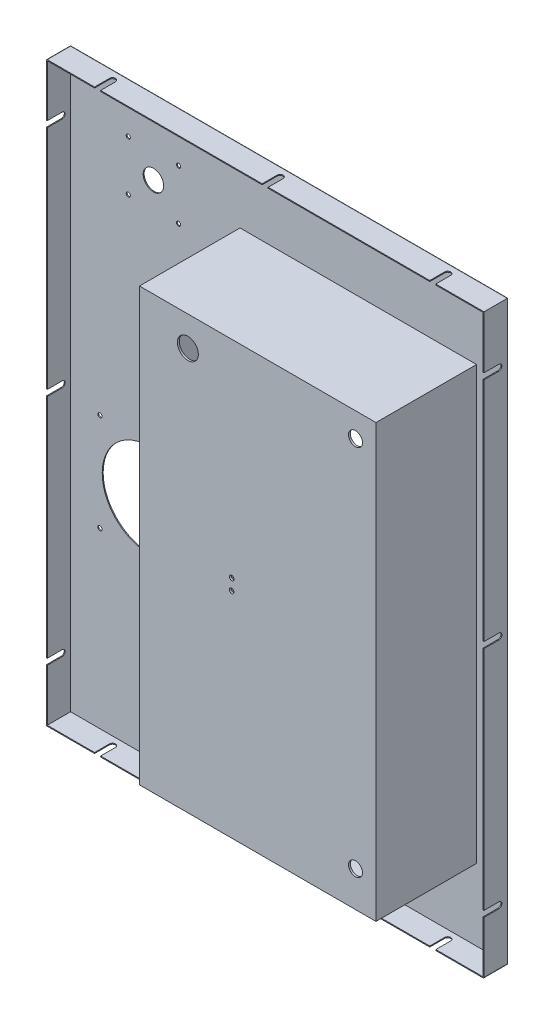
ISO-10303-21;
HEADER;
FILE_DESCRIPTION(('STEP AP214'),'2;1');
FILE_NAME('part.step','',(''),(''),'','','');
FILE_SCHEMA(('AUTOMOTIVE_DESIGN { 1 0 10303 214 1 1 1 1 }'));
ENDSEC;
DATA;
#1=APPLICATION_CONTEXT('core data for automotive mechanical design processes');
#2=APPLICATION_PROTOCOL_DEFINITION('international standard','automotive_design',2000,#1);
#3=PRODUCT_CONTEXT('',#1,'mechanical');
#4=PRODUCT('Part','Part','',(#3));
#5=PRODUCT_RELATED_PRODUCT_CATEGORY('part','',(#4));
#6=PRODUCT_DEFINITION_FORMATION('','',#4);
#7=PRODUCT_DEFINITION_CONTEXT('part definition',#1,'design');
#8=PRODUCT_DEFINITION('design','',#6,#7);
#9=PRODUCT_DEFINITION_SHAPE('','',#8);
#10=(LENGTH_UNIT() NAMED_UNIT(*) SI_UNIT(.MILLI.,.METRE.));
#11=(NAMED_UNIT(*) PLANE_ANGLE_UNIT() SI_UNIT($,.RADIAN.));
#12=(NAMED_UNIT(*) SI_UNIT($,.STERADIAN.) SOLID_ANGLE_UNIT());
#13=UNCERTAINTY_MEASURE_WITH_UNIT(LENGTH_MEASURE(1.E-05),#10,'distance_accuracy_value','');
#14=(GEOMETRIC_REPRESENTATION_CONTEXT(3) GLOBAL_UNCERTAINTY_ASSIGNED_CONTEXT((#13)) GLOBAL_UNIT_ASSIGNED_CONTEXT((#10,
#11,#12)) REPRESENTATION_CONTEXT('',''));
#15=CARTESIAN_POINT('',(0.,0.,0.));
#16=DIRECTION('',(0.,0.,1.));
#17=DIRECTION('',(1.,0.,0.));
#18=AXIS2_PLACEMENT_3D('',#15,#16,#17);
#19=CARTESIAN_POINT('',(-235.,-310.,1.));
#20=DIRECTION('',(0.,0.,1.));
#21=DIRECTION('',(1.,0.,0.));
#22=AXIS2_PLACEMENT_3D('',#19,#20,#21);
#23=PLANE('',#22);
#24=CARTESIAN_POINT('',(-172.,257.,1.));
#25=DIRECTION('',(0.,0.,1.));
#26=DIRECTION('',(1.,0.,0.));
#27=AXIS2_PLACEMENT_3D('',#24,#25,#26);
#28=CIRCLE('',#27,2.25);
#29=CARTESIAN_POINT('',(-169.75,257.,1.));
#30=VERTEX_POINT('',#29);
#31=EDGE_CURVE('E1968',#30,#30,#28,.T.);
#32=ORIENTED_EDGE('',*,*,#31,.F.);
#33=EDGE_LOOP('',(#32));
#34=FACE_BOUND('',#33,.T.);
#35=CARTESIAN_POINT('',(-172.,203.,1.));
#36=DIRECTION('',(0.,0.,1.));
#37=DIRECTION('',(1.,0.,0.));
#38=AXIS2_PLACEMENT_3D('',#35,#36,#37);
#39=CIRCLE('',#38,2.25);
#40=CARTESIAN_POINT('',(-169.75,203.,1.));
#41=VERTEX_POINT('',#40);
#42=EDGE_CURVE('E1974',#41,#41,#39,.T.);
#43=ORIENTED_EDGE('',*,*,#42,.F.);
#44=EDGE_LOOP('',(#43));
#45=FACE_BOUND('',#44,.T.);
#46=CARTESIAN_POINT('',(-118.,257.,1.));
#47=DIRECTION('',(0.,0.,1.));
#48=DIRECTION('',(1.,0.,0.));
#49=AXIS2_PLACEMENT_3D('',#46,#47,#48);
#50=CIRCLE('',#49,2.25);
#51=CARTESIAN_POINT('',(-115.75,257.,1.));
#52=VERTEX_POINT('',#51);
#53=EDGE_CURVE('E1980',#52,#52,#50,.T.);
#54=ORIENTED_EDGE('',*,*,#53,.F.);
#55=EDGE_LOOP('',(#54));
#56=FACE_BOUND('',#55,.T.);
#57=CARTESIAN_POINT('',(-118.,203.,1.));
#58=DIRECTION('',(0.,0.,1.));
#59=DIRECTION('',(1.,0.,0.));
#60=AXIS2_PLACEMENT_3D('',#57,#58,#59);
#61=CIRCLE('',#60,2.25);
#62=CARTESIAN_POINT('',(-115.75,203.,1.));
#63=VERTEX_POINT('',#62);
#64=EDGE_CURVE('E1986',#63,#63,#61,.T.);
#65=ORIENTED_EDGE('',*,*,#64,.F.);
#66=EDGE_LOOP('',(#65));
#67=FACE_BOUND('',#66,.T.);
#68=CARTESIAN_POINT('',(-145.,230.,1.));
#69=DIRECTION('',(0.,0.,1.));
#70=DIRECTION('',(1.,0.,0.));
#71=AXIS2_PLACEMENT_3D('',#68,#69,#70);
#72=CIRCLE('',#71,11.);
#73=CARTESIAN_POINT('',(-134.,230.,1.));
#74=VERTEX_POINT('',#73);
#75=EDGE_CURVE('E1992',#74,#74,#72,.T.);
#76=ORIENTED_EDGE('',*,*,#75,.F.);
#77=EDGE_LOOP('',(#76));
#78=FACE_BOUND('',#77,.T.);
#79=DIRECTION('',(0.,1.,0.));
#80=VECTOR('',#79,1.);
#81=CARTESIAN_POINT('',(234.,310.,1.));
#82=LINE('',#81,#80);
#83=CARTESIAN_POINT('',(234.,-309.,1.));
#84=VERTEX_POINT('',#83);
#85=CARTESIAN_POINT('',(234.,308.,1.));
#86=VERTEX_POINT('',#85);
#87=EDGE_CURVE('E793',#84,#86,#82,.T.);
#88=ORIENTED_EDGE('',*,*,#87,.T.);
#89=CARTESIAN_POINT('',(233.,308.,1.));
#90=DIRECTION('',(0.,0.,1.));
#91=DIRECTION('',(1.,0.,0.));
#92=AXIS2_PLACEMENT_3D('',#89,#90,#91);
#93=CIRCLE('',#92,1.);
#94=CARTESIAN_POINT('',(233.,309.,1.));
#95=VERTEX_POINT('',#94);
#96=EDGE_CURVE('E887',#86,#95,#93,.T.);
#97=ORIENTED_EDGE('',*,*,#96,.T.);
#98=DIRECTION('',(-1.,0.,0.));
#99=VECTOR('',#98,1.);
#100=CARTESIAN_POINT('',(-235.,309.,1.));
#101=LINE('',#100,#99);
#102=CARTESIAN_POINT('',(-234.,309.,1.));
#103=VERTEX_POINT('',#102);
#104=EDGE_CURVE('E798',#95,#103,#101,.T.);
#105=ORIENTED_EDGE('',*,*,#104,.T.);
#106=DIRECTION('',(0.,-1.,0.));
#107=VECTOR('',#106,1.);
#108=CARTESIAN_POINT('',(-234.,310.,1.));
#109=LINE('',#108,#107);
#110=CARTESIAN_POINT('',(-234.,-309.,1.));
#111=VERTEX_POINT('',#110);
#112=EDGE_CURVE('E778',#103,#111,#109,.T.);
#113=ORIENTED_EDGE('',*,*,#112,.T.);
#114=DIRECTION('',(1.,0.,0.));
#115=VECTOR('',#114,1.);
#116=CARTESIAN_POINT('',(-235.,-309.,1.));
#117=LINE('',#116,#115);
#118=EDGE_CURVE('E781',#111,#84,#117,.T.);
#119=ORIENTED_EDGE('',*,*,#118,.T.);
#120=EDGE_LOOP('',(#88,#97,#105,#113,#119));
#121=FACE_BOUND('',#120,.T.);
#122=CARTESIAN_POINT('',(-150.,-70.,1.));
#123=DIRECTION('',(0.,0.,1.));
#124=DIRECTION('',(1.,0.,0.));
#125=AXIS2_PLACEMENT_3D('',#122,#123,#124);
#126=CIRCLE('',#125,50.);
#127=CARTESIAN_POINT('',(-100.,-70.,1.));
#128=VERTEX_POINT('',#127);
#129=EDGE_CURVE('E548',#128,#128,#126,.T.);
#130=ORIENTED_EDGE('',*,*,#129,.F.);
#131=EDGE_LOOP('',(#130));
#132=FACE_BOUND('',#131,.T.);
#133=CARTESIAN_POINT('',(-202.5,-17.5,1.));
#134=DIRECTION('',(0.,0.,1.));
#135=DIRECTION('',(1.,0.,0.));
#136=AXIS2_PLACEMENT_3D('',#133,#134,#135);
#137=CIRCLE('',#136,2.25);
#138=CARTESIAN_POINT('',(-200.25,-17.5,1.));
#139=VERTEX_POINT('',#138);
#140=EDGE_CURVE('E542',#139,#139,#137,.T.);
#141=ORIENTED_EDGE('',*,*,#140,.F.);
#142=EDGE_LOOP('',(#141));
#143=FACE_BOUND('',#142,.T.);
#144=CARTESIAN_POINT('',(-202.5,-122.5,1.));
#145=DIRECTION('',(0.,0.,1.));
#146=DIRECTION('',(1.,0.,0.));
#147=AXIS2_PLACEMENT_3D('',#144,#145,#146);
#148=CIRCLE('',#147,2.25);
#149=CARTESIAN_POINT('',(-200.25,-122.5,1.));
#150=VERTEX_POINT('',#149);
#151=EDGE_CURVE('E538',#150,#150,#148,.T.);
#152=ORIENTED_EDGE('',*,*,#151,.F.);
#153=EDGE_LOOP('',(#152));
#154=FACE_BOUND('',#153,.T.);
#155=CARTESIAN_POINT('',(-97.5,-122.5,1.));
#156=DIRECTION('',(0.,0.,1.));
#157=DIRECTION('',(1.,0.,0.));
#158=AXIS2_PLACEMENT_3D('',#155,#156,#157);
#159=CIRCLE('',#158,2.25);
#160=CARTESIAN_POINT('',(-95.25,-122.5,1.));
#161=VERTEX_POINT('',#160);
#162=EDGE_CURVE('E534',#161,#161,#159,.T.);
#163=ORIENTED_EDGE('',*,*,#162,.F.);
#164=EDGE_LOOP('',(#163));
#165=FACE_BOUND('',#164,.T.);
#166=CARTESIAN_POINT('',(-97.5,-17.5,1.));
#167=DIRECTION('',(0.,0.,1.));
#168=DIRECTION('',(1.,0.,0.));
#169=AXIS2_PLACEMENT_3D('',#166,#167,#168);
#170=CIRCLE('',#169,2.25);
#171=CARTESIAN_POINT('',(-95.25,-17.5,1.));
#172=VERTEX_POINT('',#171);
#173=EDGE_CURVE('E20',#172,#172,#170,.T.);
#174=ORIENTED_EDGE('',*,*,#173,.F.);
#175=EDGE_LOOP('',(#174));
#176=FACE_BOUND('',#175,.T.);
#177=DIRECTION('',(0.,-1.,0.));
#178=VECTOR('',#177,1.);
#179=CARTESIAN_POINT('',(-52.,232.,1.));
#180=LINE('',#179,#178);
#181=CARTESIAN_POINT('',(-52.,232.,1.));
#182=VERTEX_POINT('',#181);
#183=CARTESIAN_POINT('',(-52.,-232.,1.));
#184=VERTEX_POINT('',#183);
#185=EDGE_CURVE('E500',#182,#184,#180,.T.);
#186=ORIENTED_EDGE('',*,*,#185,.F.);
#187=DIRECTION('',(-1.,0.,0.));
#188=VECTOR('',#187,1.);
#189=CARTESIAN_POINT('',(202.,232.,1.));
#190=LINE('',#189,#188);
#191=CARTESIAN_POINT('',(202.,232.,1.));
#192=VERTEX_POINT('',#191);
#193=EDGE_CURVE('E498',#192,#182,#190,.T.);
#194=ORIENTED_EDGE('',*,*,#193,.F.);
#195=DIRECTION('',(0.,1.,0.));
#196=VECTOR('',#195,1.);
#197=CARTESIAN_POINT('',(202.,-232.,1.));
#198=LINE('',#197,#196);
#199=CARTESIAN_POINT('',(202.,-232.,1.));
#200=VERTEX_POINT('',#199);
#201=EDGE_CURVE('E459',#200,#192,#198,.T.);
#202=ORIENTED_EDGE('',*,*,#201,.F.);
#203=DIRECTION('',(1.,0.,0.));
#204=VECTOR('',#203,1.);
#205=CARTESIAN_POINT('',(-52.,-232.,1.));
#206=LINE('',#205,#204);
#207=EDGE_CURVE('E502',#184,#200,#206,.T.);
#208=ORIENTED_EDGE('',*,*,#207,.F.);
#209=EDGE_LOOP('',(#186,#194,#202,#208));
#210=FACE_BOUND('',#209,.T.);
#211=ADVANCED_FACE('F16',(#34,#45,#56,#67,#78,#121,#132,#143,#154,#165,#176,#210),#23,.T.);
#212=CARTESIAN_POINT('',(-235.,-310.,0.));
#213=DIRECTION('',(0.,0.,1.));
#214=DIRECTION('',(1.,0.,0.));
#215=AXIS2_PLACEMENT_3D('',#212,#213,#214);
#216=PLANE('',#215);
#217=CARTESIAN_POINT('',(-172.,257.,0.));
#218=DIRECTION('',(0.,0.,-1.));
#219=DIRECTION('',(-1.,0.,0.));
#220=AXIS2_PLACEMENT_3D('',#217,#218,#219);
#221=CIRCLE('',#220,2.25);
#222=CARTESIAN_POINT('',(-174.25,257.,0.));
#223=VERTEX_POINT('',#222);
#224=EDGE_CURVE('E1963',#223,#223,#221,.T.);
#225=ORIENTED_EDGE('',*,*,#224,.F.);
#226=EDGE_LOOP('',(#225));
#227=FACE_BOUND('',#226,.T.);
#228=CARTESIAN_POINT('',(-172.,203.,0.));
#229=DIRECTION('',(0.,0.,-1.));
#230=DIRECTION('',(-1.,0.,0.));
#231=AXIS2_PLACEMENT_3D('',#228,#229,#230);
#232=CIRCLE('',#231,2.25);
#233=CARTESIAN_POINT('',(-174.25,203.,0.));
#234=VERTEX_POINT('',#233);
#235=EDGE_CURVE('E1971',#234,#234,#232,.T.);
#236=ORIENTED_EDGE('',*,*,#235,.F.);
#237=EDGE_LOOP('',(#236));
#238=FACE_BOUND('',#237,.T.);
#239=CARTESIAN_POINT('',(-118.,257.,0.));
#240=DIRECTION('',(0.,0.,-1.));
#241=DIRECTION('',(-1.,0.,0.));
#242=AXIS2_PLACEMENT_3D('',#239,#240,#241);
#243=CIRCLE('',#242,2.25);
#244=CARTESIAN_POINT('',(-120.25,257.,0.));
#245=VERTEX_POINT('',#244);
#246=EDGE_CURVE('E1977',#245,#245,#243,.T.);
#247=ORIENTED_EDGE('',*,*,#246,.F.);
#248=EDGE_LOOP('',(#247));
#249=FACE_BOUND('',#248,.T.);
#250=CARTESIAN_POINT('',(-118.,203.,0.));
#251=DIRECTION('',(0.,0.,-1.));
#252=DIRECTION('',(-1.,0.,0.));
#253=AXIS2_PLACEMENT_3D('',#250,#251,#252);
#254=CIRCLE('',#253,2.25);
#255=CARTESIAN_POINT('',(-120.25,203.,0.));
#256=VERTEX_POINT('',#255);
#257=EDGE_CURVE('E1983',#256,#256,#254,.T.);
#258=ORIENTED_EDGE('',*,*,#257,.F.);
#259=EDGE_LOOP('',(#258));
#260=FACE_BOUND('',#259,.T.);
#261=CARTESIAN_POINT('',(-145.,230.,0.));
#262=DIRECTION('',(0.,0.,-1.));
#263=DIRECTION('',(-1.,0.,0.));
#264=AXIS2_PLACEMENT_3D('',#261,#262,#263);
#265=CIRCLE('',#264,11.);
#266=CARTESIAN_POINT('',(-156.,230.,0.));
#267=VERTEX_POINT('',#266);
#268=EDGE_CURVE('E1989',#267,#267,#265,.T.);
#269=ORIENTED_EDGE('',*,*,#268,.F.);
#270=EDGE_LOOP('',(#269));
#271=FACE_BOUND('',#270,.T.);
#272=DIRECTION('',(-1.,0.,0.));
#273=VECTOR('',#272,1.);
#274=CARTESIAN_POINT('',(200.,-230.,0.));
#275=LINE('',#274,#273);
#276=CARTESIAN_POINT('',(200.,-230.,0.));
#277=VERTEX_POINT('',#276);
#278=CARTESIAN_POINT('',(-50.,-230.,0.));
#279=VERTEX_POINT('',#278);
#280=EDGE_CURVE('E511',#277,#279,#275,.T.);
#281=ORIENTED_EDGE('',*,*,#280,.F.);
#282=DIRECTION('',(0.,-1.,0.));
#283=VECTOR('',#282,1.);
#284=CARTESIAN_POINT('',(200.,-230.,0.));
#285=LINE('',#284,#283);
#286=CARTESIAN_POINT('',(200.,230.,0.));
#287=VERTEX_POINT('',#286);
#288=EDGE_CURVE('E41',#287,#277,#285,.T.);
#289=ORIENTED_EDGE('',*,*,#288,.F.);
#290=DIRECTION('',(1.,0.,0.));
#291=VECTOR('',#290,1.);
#292=CARTESIAN_POINT('',(200.,230.,0.));
#293=LINE('',#292,#291);
#294=CARTESIAN_POINT('',(-50.,230.,0.));
#295=VERTEX_POINT('',#294);
#296=EDGE_CURVE('E517',#295,#287,#293,.T.);
#297=ORIENTED_EDGE('',*,*,#296,.F.);
#298=DIRECTION('',(0.,1.,0.));
#299=VECTOR('',#298,1.);
#300=CARTESIAN_POINT('',(-50.,-230.,0.));
#301=LINE('',#300,#299);
#302=EDGE_CURVE('E514',#279,#295,#301,.T.);
#303=ORIENTED_EDGE('',*,*,#302,.F.);
#304=EDGE_LOOP('',(#281,#289,#297,#303));
#305=FACE_BOUND('',#304,.T.);
#306=CARTESIAN_POINT('',(-97.5,-17.5,0.));
#307=DIRECTION('',(0.,0.,-1.));
#308=DIRECTION('',(-1.,0.,0.));
#309=AXIS2_PLACEMENT_3D('',#306,#307,#308);
#310=CIRCLE('',#309,2.25);
#311=CARTESIAN_POINT('',(-99.75,-17.5,0.));
#312=VERTEX_POINT('',#311);
#313=EDGE_CURVE('E523',#312,#312,#310,.T.);
#314=ORIENTED_EDGE('',*,*,#313,.F.);
#315=EDGE_LOOP('',(#314));
#316=FACE_BOUND('',#315,.T.);
#317=CARTESIAN_POINT('',(-202.5,-122.5,0.));
#318=DIRECTION('',(0.,0.,-1.));
#319=DIRECTION('',(-1.,0.,0.));
#320=AXIS2_PLACEMENT_3D('',#317,#318,#319);
#321=CIRCLE('',#320,2.25);
#322=CARTESIAN_POINT('',(-204.75,-122.5,0.));
#323=VERTEX_POINT('',#322);
#324=EDGE_CURVE('E535',#323,#323,#321,.T.);
#325=ORIENTED_EDGE('',*,*,#324,.F.);
#326=EDGE_LOOP('',(#325));
#327=FACE_BOUND('',#326,.T.);
#328=CARTESIAN_POINT('',(-202.5,-17.5,0.));
#329=DIRECTION('',(0.,0.,-1.));
#330=DIRECTION('',(-1.,0.,0.));
#331=AXIS2_PLACEMENT_3D('',#328,#329,#330);
#332=CIRCLE('',#331,2.25);
#333=CARTESIAN_POINT('',(-204.75,-17.5,0.));
#334=VERTEX_POINT('',#333);
#335=EDGE_CURVE('E539',#334,#334,#332,.T.);
#336=ORIENTED_EDGE('',*,*,#335,.F.);
#337=EDGE_LOOP('',(#336));
#338=FACE_BOUND('',#337,.T.);
#339=CARTESIAN_POINT('',(-150.,-70.,0.));
#340=DIRECTION('',(0.,0.,-1.));
#341=DIRECTION('',(-1.,0.,0.));
#342=AXIS2_PLACEMENT_3D('',#339,#340,#341);
#343=CIRCLE('',#342,50.);
#344=CARTESIAN_POINT('',(-200.,-70.,0.));
#345=VERTEX_POINT('',#344);
#346=EDGE_CURVE('E545',#345,#345,#343,.T.);
#347=ORIENTED_EDGE('',*,*,#346,.F.);
#348=EDGE_LOOP('',(#347));
#349=FACE_BOUND('',#348,.T.);
#350=DIRECTION('',(0.,1.,0.));
#351=VECTOR('',#350,1.);
#352=CARTESIAN_POINT('',(234.,-310.,0.));
#353=LINE('',#352,#351);
#354=CARTESIAN_POINT('',(234.,309.,0.));
#355=VERTEX_POINT('',#354);
#356=CARTESIAN_POINT('',(234.,-309.,0.));
#357=VERTEX_POINT('',#356);
#358=EDGE_CURVE('E857',#355,#357,#353,.F.);
#359=ORIENTED_EDGE('',*,*,#358,.T.);
#360=DIRECTION('',(1.,0.,0.));
#361=VECTOR('',#360,1.);
#362=CARTESIAN_POINT('',(-235.,-309.,0.));
#363=LINE('',#362,#361);
#364=CARTESIAN_POINT('',(-234.,-309.,0.));
#365=VERTEX_POINT('',#364);
#366=EDGE_CURVE('E859',#357,#365,#363,.F.);
#367=ORIENTED_EDGE('',*,*,#366,.T.);
#368=DIRECTION('',(0.,-1.,0.));
#369=VECTOR('',#368,1.);
#370=CARTESIAN_POINT('',(-234.,-310.,0.));
#371=LINE('',#370,#369);
#372=CARTESIAN_POINT('',(-234.,309.,0.));
#373=VERTEX_POINT('',#372);
#374=EDGE_CURVE('E853',#365,#373,#371,.F.);
#375=ORIENTED_EDGE('',*,*,#374,.T.);
#376=DIRECTION('',(-1.,0.,0.));
#377=VECTOR('',#376,1.);
#378=CARTESIAN_POINT('',(-235.,309.,0.));
#379=LINE('',#378,#377);
#380=EDGE_CURVE('E855',#373,#355,#379,.F.);
#381=ORIENTED_EDGE('',*,*,#380,.T.);
#382=EDGE_LOOP('',(#359,#367,#375,#381));
#383=FACE_BOUND('',#382,.T.);
#384=CARTESIAN_POINT('',(-97.5,-122.5,0.));
#385=DIRECTION('',(0.,0.,-1.));
#386=DIRECTION('',(-1.,0.,0.));
#387=AXIS2_PLACEMENT_3D('',#384,#385,#386);
#388=CIRCLE('',#387,2.25);
#389=CARTESIAN_POINT('',(-99.75,-122.5,0.));
#390=VERTEX_POINT('',#389);
#391=EDGE_CURVE('E531',#390,#390,#388,.T.);
#392=ORIENTED_EDGE('',*,*,#391,.F.);
#393=EDGE_LOOP('',(#392));
#394=FACE_BOUND('',#393,.T.);
#395=ADVANCED_FACE('F969',(#227,#238,#249,#260,#271,#305,#316,#327,#338,#349,#383,#394),#216,.F.);
#396=CARTESIAN_POINT('',(-235.,-310.,26.));
#397=DIRECTION('',(0.,0.,1.));
#398=DIRECTION('',(1.,0.,0.));
#399=AXIS2_PLACEMENT_3D('',#396,#397,#398);
#400=PLANE('',#399);
#401=DIRECTION('',(-1.,0.,0.));
#402=VECTOR('',#401,1.);
#403=CARTESIAN_POINT('',(235.,3.25,26.));
#404=LINE('',#403,#402);
#405=CARTESIAN_POINT('',(235.,3.25,26.));
#406=VERTEX_POINT('',#405);
#407=CARTESIAN_POINT('',(234.,3.25,26.));
#408=VERTEX_POINT('',#407);
#409=EDGE_CURVE('E572',#406,#408,#404,.T.);
#410=ORIENTED_EDGE('',*,*,#409,.F.);
#411=DIRECTION('',(0.,1.,0.));
#412=VECTOR('',#411,1.);
#413=CARTESIAN_POINT('',(235.,310.,26.));
#414=LINE('',#413,#412);
#415=CARTESIAN_POINT('',(235.,246.75,26.));
#416=VERTEX_POINT('',#415);
#417=EDGE_CURVE('E837',#406,#416,#414,.T.);
#418=ORIENTED_EDGE('',*,*,#417,.T.);
#419=DIRECTION('',(-1.,0.,0.));
#420=VECTOR('',#419,1.);
#421=CARTESIAN_POINT('',(235.,246.75,26.));
#422=LINE('',#421,#420);
#423=CARTESIAN_POINT('',(234.,246.75,26.));
#424=VERTEX_POINT('',#423);
#425=EDGE_CURVE('E642',#416,#424,#422,.T.);
#426=ORIENTED_EDGE('',*,*,#425,.T.);
#427=DIRECTION('',(0.,1.,0.));
#428=VECTOR('',#427,1.);
#429=CARTESIAN_POINT('',(234.,310.,26.));
#430=LINE('',#429,#428);
#431=EDGE_CURVE('E817',#408,#424,#430,.T.);
#432=ORIENTED_EDGE('',*,*,#431,.F.);
#433=EDGE_LOOP('',(#410,#418,#426,#432));
#434=FACE_BOUND('',#433,.T.);
#435=ADVANCED_FACE('F1140',(#434),#400,.T.);
#436=CARTESIAN_POINT('',(-234.,3.25,26.));
#437=VERTEX_POINT('',#436);
#438=CARTESIAN_POINT('',(-235.,3.25,26.));
#439=VERTEX_POINT('',#438);
#440=EDGE_CURVE('E574',#437,#439,#404,.T.);
#441=ORIENTED_EDGE('',*,*,#440,.F.);
#442=DIRECTION('',(0.,-1.,0.));
#443=VECTOR('',#442,1.);
#444=CARTESIAN_POINT('',(-234.,310.,26.));
#445=LINE('',#444,#443);
#446=CARTESIAN_POINT('',(-234.,246.75,26.));
#447=VERTEX_POINT('',#446);
#448=EDGE_CURVE('E805',#447,#437,#445,.T.);
#449=ORIENTED_EDGE('',*,*,#448,.F.);
#450=CARTESIAN_POINT('',(-235.,246.75,26.));
#451=VERTEX_POINT('',#450);
#452=EDGE_CURVE('E646',#447,#451,#422,.T.);
#453=ORIENTED_EDGE('',*,*,#452,.T.);
#454=DIRECTION('',(0.,-1.,0.));
#455=VECTOR('',#454,1.);
#456=CARTESIAN_POINT('',(-235.,310.,26.));
#457=LINE('',#456,#455);
#458=EDGE_CURVE('E825',#451,#439,#457,.T.);
#459=ORIENTED_EDGE('',*,*,#458,.T.);
#460=EDGE_LOOP('',(#441,#449,#453,#459));
#461=FACE_BOUND('',#460,.T.);
#462=ADVANCED_FACE('F1262',(#461),#400,.T.);
#463=DIRECTION('',(-1.,0.,0.));
#464=VECTOR('',#463,1.);
#465=CARTESIAN_POINT('',(235.,-3.25,26.));
#466=LINE('',#465,#464);
#467=CARTESIAN_POINT('',(235.,-3.25,26.));
#468=VERTEX_POINT('',#467);
#469=CARTESIAN_POINT('',(234.,-3.25,26.));
#470=VERTEX_POINT('',#469);
#471=EDGE_CURVE('E575',#468,#470,#466,.T.);
#472=ORIENTED_EDGE('',*,*,#471,.T.);
#473=CARTESIAN_POINT('',(234.,-246.75,26.));
#474=VERTEX_POINT('',#473);
#475=EDGE_CURVE('E816',#474,#470,#430,.T.);
#476=ORIENTED_EDGE('',*,*,#475,.F.);
#477=DIRECTION('',(-1.,0.,0.));
#478=VECTOR('',#477,1.);
#479=CARTESIAN_POINT('',(235.,-246.75,26.));
#480=LINE('',#479,#478);
#481=CARTESIAN_POINT('',(235.,-246.75,26.));
#482=VERTEX_POINT('',#481);
#483=EDGE_CURVE('E609',#482,#474,#480,.T.);
#484=ORIENTED_EDGE('',*,*,#483,.F.);
#485=EDGE_CURVE('E836',#482,#468,#414,.T.);
#486=ORIENTED_EDGE('',*,*,#485,.T.);
#487=EDGE_LOOP('',(#472,#476,#484,#486));
#488=FACE_BOUND('',#487,.T.);
#489=ADVANCED_FACE('F1671',(#488),#400,.T.);
#490=CARTESIAN_POINT('',(-234.,-3.24999999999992,26.));
#491=VERTEX_POINT('',#490);
#492=CARTESIAN_POINT('',(-235.,-3.25,26.));
#493=VERTEX_POINT('',#492);
#494=EDGE_CURVE('E578',#491,#493,#466,.T.);
#495=ORIENTED_EDGE('',*,*,#494,.T.);
#496=CARTESIAN_POINT('',(-235.,-246.75,26.));
#497=VERTEX_POINT('',#496);
#498=EDGE_CURVE('E826',#493,#497,#457,.T.);
#499=ORIENTED_EDGE('',*,*,#498,.T.);
#500=CARTESIAN_POINT('',(-234.,-246.75,26.));
#501=VERTEX_POINT('',#500);
#502=EDGE_CURVE('E611',#501,#497,#480,.T.);
#503=ORIENTED_EDGE('',*,*,#502,.F.);
#504=EDGE_CURVE('E806',#491,#501,#445,.T.);
#505=ORIENTED_EDGE('',*,*,#504,.F.);
#506=EDGE_LOOP('',(#495,#499,#503,#505));
#507=FACE_BOUND('',#506,.T.);
#508=ADVANCED_FACE('F1276',(#507),#400,.T.);
#509=DIRECTION('',(-1.,0.,0.));
#510=VECTOR('',#509,1.);
#511=CARTESIAN_POINT('',(235.,-253.25,26.));
#512=LINE('',#511,#510);
#513=CARTESIAN_POINT('',(235.,-253.25,26.));
#514=VERTEX_POINT('',#513);
#515=CARTESIAN_POINT('',(234.,-253.25,26.));
#516=VERTEX_POINT('',#515);
#517=EDGE_CURVE('E612',#514,#516,#512,.T.);
#518=ORIENTED_EDGE('',*,*,#517,.T.);
#519=CARTESIAN_POINT('',(234.,-309.,26.));
#520=VERTEX_POINT('',#519);
#521=EDGE_CURVE('E812',#520,#516,#430,.T.);
#522=ORIENTED_EDGE('',*,*,#521,.F.);
#523=DIRECTION('',(1.,0.,0.));
#524=VECTOR('',#523,1.);
#525=CARTESIAN_POINT('',(-235.,-309.,26.));
#526=LINE('',#525,#524);
#527=CARTESIAN_POINT('',(183.25,-309.,26.));
#528=VERTEX_POINT('',#527);
#529=EDGE_CURVE('E804',#528,#520,#526,.T.);
#530=ORIENTED_EDGE('',*,*,#529,.F.);
#531=DIRECTION('',(0.,1.,0.));
#532=VECTOR('',#531,1.);
#533=CARTESIAN_POINT('',(183.25,-310.,26.));
#534=LINE('',#533,#532);
#535=CARTESIAN_POINT('',(183.25,-310.,26.));
#536=VERTEX_POINT('',#535);
#537=EDGE_CURVE('E686',#536,#528,#534,.T.);
#538=ORIENTED_EDGE('',*,*,#537,.F.);
#539=DIRECTION('',(1.,0.,0.));
#540=VECTOR('',#539,1.);
#541=CARTESIAN_POINT('',(-235.,-310.,26.));
#542=LINE('',#541,#540);
#543=CARTESIAN_POINT('',(234.,-310.,26.));
#544=VERTEX_POINT('',#543);
#545=EDGE_CURVE('E824',#536,#544,#542,.T.);
#546=ORIENTED_EDGE('',*,*,#545,.T.);
#547=CARTESIAN_POINT('',(234.,-309.,26.));
#548=DIRECTION('',(0.,0.,1.));
#549=DIRECTION('',(1.,0.,0.));
#550=AXIS2_PLACEMENT_3D('',#547,#548,#549);
#551=CIRCLE('',#550,1.);
#552=CARTESIAN_POINT('',(235.,-309.,26.));
#553=VERTEX_POINT('',#552);
#554=EDGE_CURVE('E882',#544,#553,#551,.T.);
#555=ORIENTED_EDGE('',*,*,#554,.T.);
#556=EDGE_CURVE('E832',#553,#514,#414,.T.);
#557=ORIENTED_EDGE('',*,*,#556,.T.);
#558=EDGE_LOOP('',(#518,#522,#530,#538,#546,#555,#557));
#559=FACE_BOUND('',#558,.T.);
#560=ADVANCED_FACE('F1655',(#559),#400,.T.);
#561=CARTESIAN_POINT('',(-234.,-253.25,26.));
#562=VERTEX_POINT('',#561);
#563=CARTESIAN_POINT('',(-235.,-253.25,26.));
#564=VERTEX_POINT('',#563);
#565=EDGE_CURVE('E615',#562,#564,#512,.T.);
#566=ORIENTED_EDGE('',*,*,#565,.T.);
#567=CARTESIAN_POINT('',(-235.,-309.,26.));
#568=VERTEX_POINT('',#567);
#569=EDGE_CURVE('E786',#564,#568,#457,.T.);
#570=ORIENTED_EDGE('',*,*,#569,.T.);
#571=CARTESIAN_POINT('',(-234.,-309.,26.));
#572=DIRECTION('',(0.,0.,1.));
#573=DIRECTION('',(1.,0.,0.));
#574=AXIS2_PLACEMENT_3D('',#571,#572,#573);
#575=CIRCLE('',#574,1.);
#576=CARTESIAN_POINT('',(-234.,-310.,26.));
#577=VERTEX_POINT('',#576);
#578=EDGE_CURVE('E880',#568,#577,#575,.T.);
#579=ORIENTED_EDGE('',*,*,#578,.T.);
#580=CARTESIAN_POINT('',(-183.25,-310.,26.));
#581=VERTEX_POINT('',#580);
#582=EDGE_CURVE('E827',#577,#581,#542,.T.);
#583=ORIENTED_EDGE('',*,*,#582,.T.);
#584=DIRECTION('',(0.,1.,0.));
#585=VECTOR('',#584,1.);
#586=CARTESIAN_POINT('',(-183.25,-310.,26.));
#587=LINE('',#586,#585);
#588=CARTESIAN_POINT('',(-183.25,-309.,26.));
#589=VERTEX_POINT('',#588);
#590=EDGE_CURVE('E765',#581,#589,#587,.T.);
#591=ORIENTED_EDGE('',*,*,#590,.T.);
#592=CARTESIAN_POINT('',(-234.,-309.,26.));
#593=VERTEX_POINT('',#592);
#594=EDGE_CURVE('E807',#593,#589,#526,.T.);
#595=ORIENTED_EDGE('',*,*,#594,.F.);
#596=EDGE_CURVE('E800',#562,#593,#445,.T.);
#597=ORIENTED_EDGE('',*,*,#596,.F.);
#598=EDGE_LOOP('',(#566,#570,#579,#583,#591,#595,#597));
#599=FACE_BOUND('',#598,.T.);
#600=ADVANCED_FACE('F1221',(#599),#400,.T.);
#601=DIRECTION('',(-1.,0.,0.));
#602=VECTOR('',#601,1.);
#603=CARTESIAN_POINT('',(235.,253.25,26.));
#604=LINE('',#603,#602);
#605=CARTESIAN_POINT('',(235.,253.25,26.));
#606=VERTEX_POINT('',#605);
#607=CARTESIAN_POINT('',(234.,253.25,26.));
#608=VERTEX_POINT('',#607);
#609=EDGE_CURVE('E655',#606,#608,#604,.T.);
#610=ORIENTED_EDGE('',*,*,#609,.F.);
#611=CARTESIAN_POINT('',(235.,310.,26.));
#612=VERTEX_POINT('',#611);
#613=EDGE_CURVE('E830',#606,#612,#414,.T.);
#614=ORIENTED_EDGE('',*,*,#613,.T.);
#615=DIRECTION('',(-1.,0.,0.));
#616=VECTOR('',#615,1.);
#617=CARTESIAN_POINT('',(-235.,310.,26.));
#618=LINE('',#617,#616);
#619=CARTESIAN_POINT('',(183.25,310.,26.));
#620=VERTEX_POINT('',#619);
#621=EDGE_CURVE('E838',#612,#620,#618,.T.);
#622=ORIENTED_EDGE('',*,*,#621,.T.);
#623=CARTESIAN_POINT('',(183.25,309.,26.));
#624=VERTEX_POINT('',#623);
#625=EDGE_CURVE('E688',#624,#620,#534,.T.);
#626=ORIENTED_EDGE('',*,*,#625,.F.);
#627=DIRECTION('',(-1.,0.,0.));
#628=VECTOR('',#627,1.);
#629=CARTESIAN_POINT('',(-235.,309.,26.));
#630=LINE('',#629,#628);
#631=CARTESIAN_POINT('',(233.,309.,26.));
#632=VERTEX_POINT('',#631);
#633=EDGE_CURVE('E791',#632,#624,#630,.T.);
#634=ORIENTED_EDGE('',*,*,#633,.F.);
#635=CARTESIAN_POINT('',(233.,308.,26.));
#636=DIRECTION('',(0.,0.,1.));
#637=DIRECTION('',(1.,0.,0.));
#638=AXIS2_PLACEMENT_3D('',#635,#636,#637);
#639=CIRCLE('',#638,1.);
#640=CARTESIAN_POINT('',(234.,308.,26.));
#641=VERTEX_POINT('',#640);
#642=EDGE_CURVE('E891',#632,#641,#639,.F.);
#643=ORIENTED_EDGE('',*,*,#642,.T.);
#644=EDGE_CURVE('E810',#608,#641,#430,.T.);
#645=ORIENTED_EDGE('',*,*,#644,.F.);
#646=EDGE_LOOP('',(#610,#614,#622,#626,#634,#643,#645));
#647=FACE_BOUND('',#646,.T.);
#648=ADVANCED_FACE('F1638',(#647),#400,.T.);
#649=DIRECTION('',(0.,1.,0.));
#650=VECTOR('',#649,1.);
#651=CARTESIAN_POINT('',(176.75,-310.,26.));
#652=LINE('',#651,#650);
#653=CARTESIAN_POINT('',(176.75,309.,26.));
#654=VERTEX_POINT('',#653);
#655=CARTESIAN_POINT('',(176.75,310.,26.));
#656=VERTEX_POINT('',#655);
#657=EDGE_CURVE('E692',#654,#656,#652,.T.);
#658=ORIENTED_EDGE('',*,*,#657,.T.);
#659=CARTESIAN_POINT('',(3.25,310.,26.));
#660=VERTEX_POINT('',#659);
#661=EDGE_CURVE('E842',#656,#660,#618,.T.);
#662=ORIENTED_EDGE('',*,*,#661,.T.);
#663=DIRECTION('',(0.,1.,0.));
#664=VECTOR('',#663,1.);
#665=CARTESIAN_POINT('',(3.25,-310.,26.));
#666=LINE('',#665,#664);
#667=CARTESIAN_POINT('',(3.25,309.,26.));
#668=VERTEX_POINT('',#667);
#669=EDGE_CURVE('E726',#668,#660,#666,.T.);
#670=ORIENTED_EDGE('',*,*,#669,.F.);
#671=EDGE_CURVE('E820',#654,#668,#630,.T.);
#672=ORIENTED_EDGE('',*,*,#671,.F.);
#673=EDGE_LOOP('',(#658,#662,#670,#672));
#674=FACE_BOUND('',#673,.T.);
#675=ADVANCED_FACE('F1629',(#674),#400,.T.);
#676=CARTESIAN_POINT('',(176.75,-310.,26.));
#677=VERTEX_POINT('',#676);
#678=CARTESIAN_POINT('',(176.75,-309.,26.));
#679=VERTEX_POINT('',#678);
#680=EDGE_CURVE('E689',#677,#679,#652,.T.);
#681=ORIENTED_EDGE('',*,*,#680,.T.);
#682=CARTESIAN_POINT('',(3.25,-309.,26.));
#683=VERTEX_POINT('',#682);
#684=EDGE_CURVE('E2050',#683,#679,#526,.T.);
#685=ORIENTED_EDGE('',*,*,#684,.F.);
#686=CARTESIAN_POINT('',(3.25,-310.,26.));
#687=VERTEX_POINT('',#686);
#688=EDGE_CURVE('E724',#687,#683,#666,.T.);
#689=ORIENTED_EDGE('',*,*,#688,.F.);
#690=EDGE_CURVE('E2035',#687,#677,#542,.T.);
#691=ORIENTED_EDGE('',*,*,#690,.T.);
#692=EDGE_LOOP('',(#681,#685,#689,#691));
#693=FACE_BOUND('',#692,.T.);
#694=ADVANCED_FACE('F1620',(#693),#400,.T.);
#695=DIRECTION('',(0.,1.,0.));
#696=VECTOR('',#695,1.);
#697=CARTESIAN_POINT('',(-3.25,-310.,26.));
#698=LINE('',#697,#696);
#699=CARTESIAN_POINT('',(-3.25,309.,26.));
#700=VERTEX_POINT('',#699);
#701=CARTESIAN_POINT('',(-3.25,310.,26.));
#702=VERTEX_POINT('',#701);
#703=EDGE_CURVE('E730',#700,#702,#698,.T.);
#704=ORIENTED_EDGE('',*,*,#703,.T.);
#705=CARTESIAN_POINT('',(-176.75,310.,26.));
#706=VERTEX_POINT('',#705);
#707=EDGE_CURVE('E2110',#702,#706,#618,.T.);
#708=ORIENTED_EDGE('',*,*,#707,.T.);
#709=DIRECTION('',(0.,1.,0.));
#710=VECTOR('',#709,1.);
#711=CARTESIAN_POINT('',(-176.75,-310.,26.));
#712=LINE('',#711,#710);
#713=CARTESIAN_POINT('',(-176.75,309.,26.));
#714=VERTEX_POINT('',#713);
#715=EDGE_CURVE('E764',#714,#706,#712,.T.);
#716=ORIENTED_EDGE('',*,*,#715,.F.);
#717=EDGE_CURVE('E2098',#700,#714,#630,.T.);
#718=ORIENTED_EDGE('',*,*,#717,.F.);
#719=EDGE_LOOP('',(#704,#708,#716,#718));
#720=FACE_BOUND('',#719,.T.);
#721=ADVANCED_FACE('F1611',(#720),#400,.T.);
#722=CARTESIAN_POINT('',(-3.25,-310.,26.));
#723=VERTEX_POINT('',#722);
#724=CARTESIAN_POINT('',(-3.25,-309.,26.));
#725=VERTEX_POINT('',#724);
#726=EDGE_CURVE('E727',#723,#725,#698,.T.);
#727=ORIENTED_EDGE('',*,*,#726,.T.);
#728=CARTESIAN_POINT('',(-176.75,-309.,26.));
#729=VERTEX_POINT('',#728);
#730=EDGE_CURVE('E811',#729,#725,#526,.T.);
#731=ORIENTED_EDGE('',*,*,#730,.F.);
#732=CARTESIAN_POINT('',(-176.75,-310.,26.));
#733=VERTEX_POINT('',#732);
#734=EDGE_CURVE('E762',#733,#729,#712,.T.);
#735=ORIENTED_EDGE('',*,*,#734,.F.);
#736=EDGE_CURVE('E831',#733,#723,#542,.T.);
#737=ORIENTED_EDGE('',*,*,#736,.T.);
#738=EDGE_LOOP('',(#727,#731,#735,#737));
#739=FACE_BOUND('',#738,.T.);
#740=ADVANCED_FACE('F1141',(#739),#400,.T.);
#741=CARTESIAN_POINT('',(-235.,310.,26.));
#742=DIRECTION('',(1.,0.,0.));
#743=DIRECTION('',(0.,0.,-1.));
#744=AXIS2_PLACEMENT_3D('',#741,#742,#743);
#745=PLANE('',#744);
#746=CARTESIAN_POINT('',(-235.,0.,10.));
#747=DIRECTION('',(-1.,0.,0.));
#748=DIRECTION('',(0.,0.,1.));
#749=AXIS2_PLACEMENT_3D('',#746,#747,#748);
#750=CIRCLE('',#749,3.25);
#751=CARTESIAN_POINT('',(-235.,3.25,10.));
#752=VERTEX_POINT('',#751);
#753=CARTESIAN_POINT('',(-235.,-3.25,10.));
#754=VERTEX_POINT('',#753);
#755=EDGE_CURVE('E560',#752,#754,#750,.T.);
#756=ORIENTED_EDGE('',*,*,#755,.F.);
#757=DIRECTION('',(0.,0.,-1.));
#758=VECTOR('',#757,1.);
#759=CARTESIAN_POINT('',(-235.,3.25,10.));
#760=LINE('',#759,#758);
#761=EDGE_CURVE('E553',#439,#752,#760,.T.);
#762=ORIENTED_EDGE('',*,*,#761,.F.);
#763=ORIENTED_EDGE('',*,*,#458,.F.);
#764=DIRECTION('',(0.,0.,1.));
#765=VECTOR('',#764,1.);
#766=CARTESIAN_POINT('',(-235.,246.75,26.));
#767=LINE('',#766,#765);
#768=CARTESIAN_POINT('',(-235.,246.75,10.));
#769=VERTEX_POINT('',#768);
#770=EDGE_CURVE('E629',#769,#451,#767,.T.);
#771=ORIENTED_EDGE('',*,*,#770,.F.);
#772=CARTESIAN_POINT('',(-235.,250.,10.));
#773=DIRECTION('',(-1.,0.,0.));
#774=DIRECTION('',(0.,0.,1.));
#775=AXIS2_PLACEMENT_3D('',#772,#773,#774);
#776=CIRCLE('',#775,3.25);
#777=CARTESIAN_POINT('',(-235.,253.25,10.));
#778=VERTEX_POINT('',#777);
#779=EDGE_CURVE('E638',#778,#769,#776,.T.);
#780=ORIENTED_EDGE('',*,*,#779,.F.);
#781=DIRECTION('',(0.,0.,-1.));
#782=VECTOR('',#781,1.);
#783=CARTESIAN_POINT('',(-235.,253.25,26.));
#784=LINE('',#783,#782);
#785=CARTESIAN_POINT('',(-235.,253.25,26.));
#786=VERTEX_POINT('',#785);
#787=EDGE_CURVE('E624',#786,#778,#784,.T.);
#788=ORIENTED_EDGE('',*,*,#787,.F.);
#789=CARTESIAN_POINT('',(-235.,309.,26.));
#790=VERTEX_POINT('',#789);
#791=EDGE_CURVE('E821',#790,#786,#457,.T.);
#792=ORIENTED_EDGE('',*,*,#791,.F.);
#793=DIRECTION('',(0.,0.,-1.));
#794=VECTOR('',#793,1.);
#795=CARTESIAN_POINT('',(-235.,309.,26.));
#796=LINE('',#795,#794);
#797=CARTESIAN_POINT('',(-235.,309.,1.));
#798=VERTEX_POINT('',#797);
#799=EDGE_CURVE('E871',#790,#798,#796,.T.);
#800=ORIENTED_EDGE('',*,*,#799,.T.);
#801=DIRECTION('',(0.,-1.,0.));
#802=VECTOR('',#801,1.);
#803=CARTESIAN_POINT('',(-235.,310.,1.));
#804=LINE('',#803,#802);
#805=CARTESIAN_POINT('',(-235.,-309.,1.));
#806=VERTEX_POINT('',#805);
#807=EDGE_CURVE('E873',#798,#806,#804,.T.);
#808=ORIENTED_EDGE('',*,*,#807,.T.);
#809=DIRECTION('',(0.,0.,-1.));
#810=VECTOR('',#809,1.);
#811=CARTESIAN_POINT('',(-235.,-309.,26.));
#812=LINE('',#811,#810);
#813=EDGE_CURVE('E875',#806,#568,#812,.F.);
#814=ORIENTED_EDGE('',*,*,#813,.T.);
#815=ORIENTED_EDGE('',*,*,#569,.F.);
#816=DIRECTION('',(0.,0.,1.));
#817=VECTOR('',#816,1.);
#818=CARTESIAN_POINT('',(-235.,-253.25,26.));
#819=LINE('',#818,#817);
#820=CARTESIAN_POINT('',(-235.,-253.25,10.));
#821=VERTEX_POINT('',#820);
#822=EDGE_CURVE('E600',#821,#564,#819,.T.);
#823=ORIENTED_EDGE('',*,*,#822,.F.);
#824=CARTESIAN_POINT('',(-235.,-250.,10.));
#825=DIRECTION('',(-1.,0.,0.));
#826=DIRECTION('',(0.,0.,-1.));
#827=AXIS2_PLACEMENT_3D('',#824,#825,#826);
#828=CIRCLE('',#827,3.25);
#829=CARTESIAN_POINT('',(-235.,-246.75,10.));
#830=VERTEX_POINT('',#829);
#831=EDGE_CURVE('E586',#830,#821,#828,.T.);
#832=ORIENTED_EDGE('',*,*,#831,.F.);
#833=DIRECTION('',(0.,0.,-1.));
#834=VECTOR('',#833,1.);
#835=CARTESIAN_POINT('',(-235.,-246.75,26.));
#836=LINE('',#835,#834);
#837=EDGE_CURVE('E591',#497,#830,#836,.T.);
#838=ORIENTED_EDGE('',*,*,#837,.F.);
#839=ORIENTED_EDGE('',*,*,#498,.F.);
#840=DIRECTION('',(0.,0.,1.));
#841=VECTOR('',#840,1.);
#842=CARTESIAN_POINT('',(-235.,-3.25,10.));
#843=LINE('',#842,#841);
#844=EDGE_CURVE('E563',#754,#493,#843,.T.);
#845=ORIENTED_EDGE('',*,*,#844,.F.);
#846=EDGE_LOOP('',(#756,#762,#763,#771,#780,#788,#792,#800,#808,#814,#815,#823,#832,#838,#839,#845));
#847=FACE_BOUND('',#846,.T.);
#848=ADVANCED_FACE('F1155',(#847),#745,.F.);
#849=CARTESIAN_POINT('',(-235.,-310.,26.));
#850=DIRECTION('',(0.,1.,0.));
#851=DIRECTION('',(0.,0.,1.));
#852=AXIS2_PLACEMENT_3D('',#849,#850,#851);
#853=PLANE('',#852);
#854=ORIENTED_EDGE('',*,*,#545,.F.);
#855=DIRECTION('',(0.,0.,-1.));
#856=VECTOR('',#855,1.);
#857=CARTESIAN_POINT('',(183.25,-310.,10.));
#858=LINE('',#857,#856);
#859=CARTESIAN_POINT('',(183.25,-310.,10.));
#860=VERTEX_POINT('',#859);
#861=EDGE_CURVE('E671',#536,#860,#858,.T.);
#862=ORIENTED_EDGE('',*,*,#861,.T.);
#863=CARTESIAN_POINT('',(180.,-310.,10.));
#864=DIRECTION('',(0.,1.,0.));
#865=DIRECTION('',(0.,0.,-1.));
#866=AXIS2_PLACEMENT_3D('',#863,#864,#865);
#867=CIRCLE('',#866,3.25);
#868=CARTESIAN_POINT('',(176.75,-310.,10.));
#869=VERTEX_POINT('',#868);
#870=EDGE_CURVE('E664',#860,#869,#867,.T.);
#871=ORIENTED_EDGE('',*,*,#870,.T.);
#872=DIRECTION('',(0.,0.,1.));
#873=VECTOR('',#872,1.);
#874=CARTESIAN_POINT('',(176.75,-310.,10.));
#875=LINE('',#874,#873);
#876=EDGE_CURVE('E667',#869,#677,#875,.T.);
#877=ORIENTED_EDGE('',*,*,#876,.T.);
#878=ORIENTED_EDGE('',*,*,#690,.F.);
#879=DIRECTION('',(0.,0.,-1.));
#880=VECTOR('',#879,1.);
#881=CARTESIAN_POINT('',(3.25,-310.,10.));
#882=LINE('',#881,#880);
#883=CARTESIAN_POINT('',(3.25,-310.,10.));
#884=VERTEX_POINT('',#883);
#885=EDGE_CURVE('E709',#687,#884,#882,.T.);
#886=ORIENTED_EDGE('',*,*,#885,.T.);
#887=CARTESIAN_POINT('',(0.,-310.,10.));
#888=DIRECTION('',(0.,1.,0.));
#889=DIRECTION('',(0.,0.,1.));
#890=AXIS2_PLACEMENT_3D('',#887,#888,#889);
#891=CIRCLE('',#890,3.25);
#892=CARTESIAN_POINT('',(-3.25,-310.,10.));
#893=VERTEX_POINT('',#892);
#894=EDGE_CURVE('E702',#884,#893,#891,.T.);
#895=ORIENTED_EDGE('',*,*,#894,.T.);
#896=DIRECTION('',(0.,0.,1.));
#897=VECTOR('',#896,1.);
#898=CARTESIAN_POINT('',(-3.25,-310.,10.));
#899=LINE('',#898,#897);
#900=EDGE_CURVE('E705',#893,#723,#899,.T.);
#901=ORIENTED_EDGE('',*,*,#900,.T.);
#902=ORIENTED_EDGE('',*,*,#736,.F.);
#903=DIRECTION('',(0.,0.,-1.));
#904=VECTOR('',#903,1.);
#905=CARTESIAN_POINT('',(-176.75,-310.,10.));
#906=LINE('',#905,#904);
#907=CARTESIAN_POINT('',(-176.75,-310.,10.));
#908=VERTEX_POINT('',#907);
#909=EDGE_CURVE('E747',#733,#908,#906,.T.);
#910=ORIENTED_EDGE('',*,*,#909,.T.);
#911=CARTESIAN_POINT('',(-180.,-310.,10.));
#912=DIRECTION('',(0.,1.,0.));
#913=DIRECTION('',(0.,0.,1.));
#914=AXIS2_PLACEMENT_3D('',#911,#912,#913);
#915=CIRCLE('',#914,3.25);
#916=CARTESIAN_POINT('',(-183.25,-310.,10.));
#917=VERTEX_POINT('',#916);
#918=EDGE_CURVE('E740',#908,#917,#915,.T.);
#919=ORIENTED_EDGE('',*,*,#918,.T.);
#920=DIRECTION('',(0.,0.,1.));
#921=VECTOR('',#920,1.);
#922=CARTESIAN_POINT('',(-183.25,-310.,10.));
#923=LINE('',#922,#921);
#924=EDGE_CURVE('E743',#917,#581,#923,.T.);
#925=ORIENTED_EDGE('',*,*,#924,.T.);
#926=ORIENTED_EDGE('',*,*,#582,.F.);
#927=DIRECTION('',(0.,0.,-1.));
#928=VECTOR('',#927,1.);
#929=CARTESIAN_POINT('',(-234.,-310.,26.));
#930=LINE('',#929,#928);
#931=CARTESIAN_POINT('',(-234.,-310.,1.));
#932=VERTEX_POINT('',#931);
#933=EDGE_CURVE('E845',#577,#932,#930,.T.);
#934=ORIENTED_EDGE('',*,*,#933,.T.);
#935=DIRECTION('',(1.,0.,0.));
#936=VECTOR('',#935,1.);
#937=CARTESIAN_POINT('',(-235.,-310.,1.));
#938=LINE('',#937,#936);
#939=CARTESIAN_POINT('',(234.,-310.,1.));
#940=VERTEX_POINT('',#939);
#941=EDGE_CURVE('E847',#932,#940,#938,.T.);
#942=ORIENTED_EDGE('',*,*,#941,.T.);
#943=DIRECTION('',(0.,0.,-1.));
#944=VECTOR('',#943,1.);
#945=CARTESIAN_POINT('',(234.,-310.,26.));
#946=LINE('',#945,#944);
#947=EDGE_CURVE('E850',#940,#544,#946,.F.);
#948=ORIENTED_EDGE('',*,*,#947,.T.);
#949=EDGE_LOOP('',(#854,#862,#871,#877,#878,#886,#895,#901,#902,#910,#919,#925,#926,#934,#942,#948));
#950=FACE_BOUND('',#949,.T.);
#951=ADVANCED_FACE('F1151',(#950),#853,.F.);
#952=CARTESIAN_POINT('',(235.,310.,26.));
#953=DIRECTION('',(-1.,0.,0.));
#954=DIRECTION('',(0.,0.,1.));
#955=AXIS2_PLACEMENT_3D('',#952,#953,#954);
#956=PLANE('',#955);
#957=ORIENTED_EDGE('',*,*,#417,.F.);
#958=DIRECTION('',(0.,0.,-1.));
#959=VECTOR('',#958,1.);
#960=CARTESIAN_POINT('',(235.,3.25,10.));
#961=LINE('',#960,#959);
#962=CARTESIAN_POINT('',(235.,3.25,10.));
#963=VERTEX_POINT('',#962);
#964=EDGE_CURVE('E556',#406,#963,#961,.T.);
#965=ORIENTED_EDGE('',*,*,#964,.T.);
#966=CARTESIAN_POINT('',(235.,0.,10.));
#967=DIRECTION('',(-1.,0.,0.));
#968=DIRECTION('',(0.,0.,1.));
#969=AXIS2_PLACEMENT_3D('',#966,#967,#968);
#970=CIRCLE('',#969,3.25);
#971=CARTESIAN_POINT('',(235.,-3.25,10.));
#972=VERTEX_POINT('',#971);
#973=EDGE_CURVE('E549',#963,#972,#970,.T.);
#974=ORIENTED_EDGE('',*,*,#973,.T.);
#975=DIRECTION('',(0.,0.,1.));
#976=VECTOR('',#975,1.);
#977=CARTESIAN_POINT('',(235.,-3.25,10.));
#978=LINE('',#977,#976);
#979=EDGE_CURVE('E552',#972,#468,#978,.T.);
#980=ORIENTED_EDGE('',*,*,#979,.T.);
#981=ORIENTED_EDGE('',*,*,#485,.F.);
#982=DIRECTION('',(0.,0.,-1.));
#983=VECTOR('',#982,1.);
#984=CARTESIAN_POINT('',(235.,-246.75,26.));
#985=LINE('',#984,#983);
#986=CARTESIAN_POINT('',(235.,-246.75,10.));
#987=VERTEX_POINT('',#986);
#988=EDGE_CURVE('E594',#482,#987,#985,.T.);
#989=ORIENTED_EDGE('',*,*,#988,.T.);
#990=CARTESIAN_POINT('',(235.,-250.,10.));
#991=DIRECTION('',(-1.,0.,0.));
#992=DIRECTION('',(0.,0.,-1.));
#993=AXIS2_PLACEMENT_3D('',#990,#991,#992);
#994=CIRCLE('',#993,3.25);
#995=CARTESIAN_POINT('',(235.,-253.25,10.));
#996=VERTEX_POINT('',#995);
#997=EDGE_CURVE('E587',#987,#996,#994,.T.);
#998=ORIENTED_EDGE('',*,*,#997,.T.);
#999=DIRECTION('',(0.,0.,1.));
#1000=VECTOR('',#999,1.);
#1001=CARTESIAN_POINT('',(235.,-253.25,26.));
#1002=LINE('',#1001,#1000);
#1003=EDGE_CURVE('E590',#996,#514,#1002,.T.);
#1004=ORIENTED_EDGE('',*,*,#1003,.T.);
#1005=ORIENTED_EDGE('',*,*,#556,.F.);
#1006=DIRECTION('',(0.,0.,-1.));
#1007=VECTOR('',#1006,1.);
#1008=CARTESIAN_POINT('',(235.,-309.,26.));
#1009=LINE('',#1008,#1007);
#1010=CARTESIAN_POINT('',(235.,-309.,1.));
#1011=VERTEX_POINT('',#1010);
#1012=EDGE_CURVE('E862',#553,#1011,#1009,.T.);
#1013=ORIENTED_EDGE('',*,*,#1012,.T.);
#1014=DIRECTION('',(0.,1.,0.));
#1015=VECTOR('',#1014,1.);
#1016=CARTESIAN_POINT('',(235.,310.,1.));
#1017=LINE('',#1016,#1015);
#1018=CARTESIAN_POINT('',(235.,310.,1.));
#1019=VERTEX_POINT('',#1018);
#1020=EDGE_CURVE('E864',#1011,#1019,#1017,.T.);
#1021=ORIENTED_EDGE('',*,*,#1020,.T.);
#1022=DIRECTION('',(0.,0.,-1.));
#1023=VECTOR('',#1022,1.);
#1024=CARTESIAN_POINT('',(235.,310.,26.));
#1025=LINE('',#1024,#1023);
#1026=EDGE_CURVE('E841',#612,#1019,#1025,.T.);
#1027=ORIENTED_EDGE('',*,*,#1026,.F.);
#1028=ORIENTED_EDGE('',*,*,#613,.F.);
#1029=DIRECTION('',(0.,0.,-1.));
#1030=VECTOR('',#1029,1.);
#1031=CARTESIAN_POINT('',(235.,253.25,26.));
#1032=LINE('',#1031,#1030);
#1033=CARTESIAN_POINT('',(235.,253.25,10.));
#1034=VERTEX_POINT('',#1033);
#1035=EDGE_CURVE('E625',#606,#1034,#1032,.T.);
#1036=ORIENTED_EDGE('',*,*,#1035,.T.);
#1037=CARTESIAN_POINT('',(235.,250.,10.));
#1038=DIRECTION('',(-1.,0.,0.));
#1039=DIRECTION('',(0.,0.,1.));
#1040=AXIS2_PLACEMENT_3D('',#1037,#1038,#1039);
#1041=CIRCLE('',#1040,3.25);
#1042=CARTESIAN_POINT('',(235.,246.75,10.));
#1043=VERTEX_POINT('',#1042);
#1044=EDGE_CURVE('E628',#1034,#1043,#1041,.T.);
#1045=ORIENTED_EDGE('',*,*,#1044,.T.);
#1046=DIRECTION('',(0.,0.,1.));
#1047=VECTOR('',#1046,1.);
#1048=CARTESIAN_POINT('',(235.,246.75,26.));
#1049=LINE('',#1048,#1047);
#1050=EDGE_CURVE('E632',#1043,#416,#1049,.T.);
#1051=ORIENTED_EDGE('',*,*,#1050,.T.);
#1052=EDGE_LOOP('',(#957,#965,#974,#980,#981,#989,#998,#1004,#1005,#1013,#1021,#1027,#1028,
#1036,#1045,#1051));
#1053=FACE_BOUND('',#1052,.T.);
#1054=ADVANCED_FACE('F1147',(#1053),#956,.F.);
#1055=CARTESIAN_POINT('',(-235.,310.,26.));
#1056=DIRECTION('',(0.,-1.,0.));
#1057=DIRECTION('',(0.,0.,-1.));
#1058=AXIS2_PLACEMENT_3D('',#1055,#1056,#1057);
#1059=PLANE('',#1058);
#1060=CARTESIAN_POINT('',(180.,310.,10.));
#1061=DIRECTION('',(0.,1.,0.));
#1062=DIRECTION('',(0.,0.,-1.));
#1063=AXIS2_PLACEMENT_3D('',#1060,#1061,#1062);
#1064=CIRCLE('',#1063,3.25);
#1065=CARTESIAN_POINT('',(183.25,310.,10.));
#1066=VERTEX_POINT('',#1065);
#1067=CARTESIAN_POINT('',(176.75,310.,10.));
#1068=VERTEX_POINT('',#1067);
#1069=EDGE_CURVE('E663',#1066,#1068,#1064,.T.);
#1070=ORIENTED_EDGE('',*,*,#1069,.F.);
#1071=DIRECTION('',(0.,0.,-1.));
#1072=VECTOR('',#1071,1.);
#1073=CARTESIAN_POINT('',(183.25,310.,10.));
#1074=LINE('',#1073,#1072);
#1075=EDGE_CURVE('E668',#620,#1066,#1074,.T.);
#1076=ORIENTED_EDGE('',*,*,#1075,.F.);
#1077=ORIENTED_EDGE('',*,*,#621,.F.);
#1078=ORIENTED_EDGE('',*,*,#1026,.T.);
#1079=DIRECTION('',(-1.,0.,0.));
#1080=VECTOR('',#1079,1.);
#1081=CARTESIAN_POINT('',(-235.,310.,1.));
#1082=LINE('',#1081,#1080);
#1083=CARTESIAN_POINT('',(-234.,310.,1.));
#1084=VERTEX_POINT('',#1083);
#1085=EDGE_CURVE('E869',#1019,#1084,#1082,.T.);
#1086=ORIENTED_EDGE('',*,*,#1085,.T.);
#1087=DIRECTION('',(0.,0.,-1.));
#1088=VECTOR('',#1087,1.);
#1089=CARTESIAN_POINT('',(-234.,310.,26.));
#1090=LINE('',#1089,#1088);
#1091=CARTESIAN_POINT('',(-234.,310.,26.));
#1092=VERTEX_POINT('',#1091);
#1093=EDGE_CURVE('E866',#1084,#1092,#1090,.F.);
#1094=ORIENTED_EDGE('',*,*,#1093,.T.);
#1095=CARTESIAN_POINT('',(-183.25,310.,26.));
#1096=VERTEX_POINT('',#1095);
#1097=EDGE_CURVE('E835',#1096,#1092,#618,.T.);
#1098=ORIENTED_EDGE('',*,*,#1097,.F.);
#1099=DIRECTION('',(0.,0.,1.));
#1100=VECTOR('',#1099,1.);
#1101=CARTESIAN_POINT('',(-183.25,310.,10.));
#1102=LINE('',#1101,#1100);
#1103=CARTESIAN_POINT('',(-183.25,310.,10.));
#1104=VERTEX_POINT('',#1103);
#1105=EDGE_CURVE('E753',#1104,#1096,#1102,.T.);
#1106=ORIENTED_EDGE('',*,*,#1105,.F.);
#1107=CARTESIAN_POINT('',(-180.,310.,10.));
#1108=DIRECTION('',(0.,1.,0.));
#1109=DIRECTION('',(0.,0.,1.));
#1110=AXIS2_PLACEMENT_3D('',#1107,#1108,#1109);
#1111=CIRCLE('',#1110,3.25);
#1112=CARTESIAN_POINT('',(-176.75,310.,10.));
#1113=VERTEX_POINT('',#1112);
#1114=EDGE_CURVE('E739',#1113,#1104,#1111,.T.);
#1115=ORIENTED_EDGE('',*,*,#1114,.F.);
#1116=DIRECTION('',(0.,0.,-1.));
#1117=VECTOR('',#1116,1.);
#1118=CARTESIAN_POINT('',(-176.75,310.,10.));
#1119=LINE('',#1118,#1117);
#1120=EDGE_CURVE('E744',#706,#1113,#1119,.T.);
#1121=ORIENTED_EDGE('',*,*,#1120,.F.);
#1122=ORIENTED_EDGE('',*,*,#707,.F.);
#1123=DIRECTION('',(0.,0.,1.));
#1124=VECTOR('',#1123,1.);
#1125=CARTESIAN_POINT('',(-3.25,310.,10.));
#1126=LINE('',#1125,#1124);
#1127=CARTESIAN_POINT('',(-3.25,310.,10.));
#1128=VERTEX_POINT('',#1127);
#1129=EDGE_CURVE('E715',#1128,#702,#1126,.T.);
#1130=ORIENTED_EDGE('',*,*,#1129,.F.);
#1131=CARTESIAN_POINT('',(0.,310.,10.));
#1132=DIRECTION('',(0.,1.,0.));
#1133=DIRECTION('',(0.,0.,1.));
#1134=AXIS2_PLACEMENT_3D('',#1131,#1132,#1133);
#1135=CIRCLE('',#1134,3.25);
#1136=CARTESIAN_POINT('',(3.25,310.,10.));
#1137=VERTEX_POINT('',#1136);
#1138=EDGE_CURVE('E701',#1137,#1128,#1135,.T.);
#1139=ORIENTED_EDGE('',*,*,#1138,.F.);
#1140=DIRECTION('',(0.,0.,-1.));
#1141=VECTOR('',#1140,1.);
#1142=CARTESIAN_POINT('',(3.25,310.,10.));
#1143=LINE('',#1142,#1141);
#1144=EDGE_CURVE('E706',#660,#1137,#1143,.T.);
#1145=ORIENTED_EDGE('',*,*,#1144,.F.);
#1146=ORIENTED_EDGE('',*,*,#661,.F.);
#1147=DIRECTION('',(0.,0.,1.));
#1148=VECTOR('',#1147,1.);
#1149=CARTESIAN_POINT('',(176.75,310.,10.));
#1150=LINE('',#1149,#1148);
#1151=EDGE_CURVE('E677',#1068,#656,#1150,.T.);
#1152=ORIENTED_EDGE('',*,*,#1151,.F.);
#1153=EDGE_LOOP('',(#1070,#1076,#1077,#1078,#1086,#1094,#1098,#1106,#1115,#1121,#1122,#1130,
#1139,#1145,#1146,#1152));
#1154=FACE_BOUND('',#1153,.T.);
#1155=ADVANCED_FACE('F1138',(#1154),#1059,.F.);
#1156=CARTESIAN_POINT('',(-234.,253.25,26.));
#1157=VERTEX_POINT('',#1156);
#1158=EDGE_CURVE('E635',#1157,#786,#604,.T.);
#1159=ORIENTED_EDGE('',*,*,#1158,.F.);
#1160=CARTESIAN_POINT('',(-234.,309.,26.));
#1161=VERTEX_POINT('',#1160);
#1162=EDGE_CURVE('E801',#1161,#1157,#445,.T.);
#1163=ORIENTED_EDGE('',*,*,#1162,.F.);
#1164=CARTESIAN_POINT('',(-183.25,309.,26.));
#1165=VERTEX_POINT('',#1164);
#1166=EDGE_CURVE('E815',#1165,#1161,#630,.T.);
#1167=ORIENTED_EDGE('',*,*,#1166,.F.);
#1168=EDGE_CURVE('E768',#1165,#1096,#587,.T.);
#1169=ORIENTED_EDGE('',*,*,#1168,.T.);
#1170=ORIENTED_EDGE('',*,*,#1097,.T.);
#1171=CARTESIAN_POINT('',(-234.,309.,26.));
#1172=DIRECTION('',(0.,0.,1.));
#1173=DIRECTION('',(1.,0.,0.));
#1174=AXIS2_PLACEMENT_3D('',#1171,#1172,#1173);
#1175=CIRCLE('',#1174,1.);
#1176=EDGE_CURVE('E878',#1092,#790,#1175,.T.);
#1177=ORIENTED_EDGE('',*,*,#1176,.T.);
#1178=ORIENTED_EDGE('',*,*,#791,.T.);
#1179=EDGE_LOOP('',(#1159,#1163,#1167,#1169,#1170,#1177,#1178));
#1180=FACE_BOUND('',#1179,.T.);
#1181=ADVANCED_FACE('F1122',(#1180),#400,.T.);
#1182=CARTESIAN_POINT('',(-234.,310.,26.));
#1183=DIRECTION('',(1.,0.,0.));
#1184=DIRECTION('',(0.,0.,-1.));
#1185=AXIS2_PLACEMENT_3D('',#1182,#1183,#1184);
#1186=PLANE('',#1185);
#1187=DIRECTION('',(0.,0.,1.));
#1188=VECTOR('',#1187,1.);
#1189=CARTESIAN_POINT('',(-234.,3.25,26.));
#1190=LINE('',#1189,#1188);
#1191=CARTESIAN_POINT('',(-234.,3.25,10.));
#1192=VERTEX_POINT('',#1191);
#1193=EDGE_CURVE('E582',#1192,#437,#1190,.T.);
#1194=ORIENTED_EDGE('',*,*,#1193,.F.);
#1195=CARTESIAN_POINT('',(-234.,0.,10.));
#1196=DIRECTION('',(1.,0.,0.));
#1197=DIRECTION('',(0.,0.,-1.));
#1198=AXIS2_PLACEMENT_3D('',#1195,#1196,#1197);
#1199=CIRCLE('',#1198,3.25);
#1200=CARTESIAN_POINT('',(-234.,-3.25,10.));
#1201=VERTEX_POINT('',#1200);
#1202=EDGE_CURVE('E584',#1201,#1192,#1199,.T.);
#1203=ORIENTED_EDGE('',*,*,#1202,.F.);
#1204=DIRECTION('',(0.,0.,-1.));
#1205=VECTOR('',#1204,1.);
#1206=CARTESIAN_POINT('',(-234.,-3.24999999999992,26.));
#1207=LINE('',#1206,#1205);
#1208=EDGE_CURVE('E570',#491,#1201,#1207,.T.);
#1209=ORIENTED_EDGE('',*,*,#1208,.F.);
#1210=ORIENTED_EDGE('',*,*,#504,.T.);
#1211=DIRECTION('',(0.,0.,1.));
#1212=VECTOR('',#1211,1.);
#1213=CARTESIAN_POINT('',(-234.,-246.75,26.));
#1214=LINE('',#1213,#1212);
#1215=CARTESIAN_POINT('',(-234.,-246.75,10.));
#1216=VERTEX_POINT('',#1215);
#1217=EDGE_CURVE('E619',#1216,#501,#1214,.T.);
#1218=ORIENTED_EDGE('',*,*,#1217,.F.);
#1219=CARTESIAN_POINT('',(-234.,-250.,10.));
#1220=DIRECTION('',(1.,0.,0.));
#1221=DIRECTION('',(0.,0.,-1.));
#1222=AXIS2_PLACEMENT_3D('',#1219,#1220,#1221);
#1223=CIRCLE('',#1222,3.25);
#1224=CARTESIAN_POINT('',(-234.,-253.25,10.));
#1225=VERTEX_POINT('',#1224);
#1226=EDGE_CURVE('E622',#1225,#1216,#1223,.T.);
#1227=ORIENTED_EDGE('',*,*,#1226,.F.);
#1228=DIRECTION('',(0.,0.,-1.));
#1229=VECTOR('',#1228,1.);
#1230=CARTESIAN_POINT('',(-234.,-253.25,26.));
#1231=LINE('',#1230,#1229);
#1232=EDGE_CURVE('E607',#562,#1225,#1231,.T.);
#1233=ORIENTED_EDGE('',*,*,#1232,.F.);
#1234=ORIENTED_EDGE('',*,*,#596,.T.);
#1235=DIRECTION('',(0.,0.,-1.));
#1236=VECTOR('',#1235,1.);
#1237=CARTESIAN_POINT('',(-234.,-309.,26.));
#1238=LINE('',#1237,#1236);
#1239=EDGE_CURVE('E783',#593,#111,#1238,.T.);
#1240=ORIENTED_EDGE('',*,*,#1239,.T.);
#1241=ORIENTED_EDGE('',*,*,#112,.F.);
#1242=DIRECTION('',(0.,0.,-1.));
#1243=VECTOR('',#1242,1.);
#1244=CARTESIAN_POINT('',(-234.,309.,26.));
#1245=LINE('',#1244,#1243);
#1246=EDGE_CURVE('E788',#1161,#103,#1245,.T.);
#1247=ORIENTED_EDGE('',*,*,#1246,.F.);
#1248=ORIENTED_EDGE('',*,*,#1162,.T.);
#1249=DIRECTION('',(0.,0.,1.));
#1250=VECTOR('',#1249,1.);
#1251=CARTESIAN_POINT('',(-234.,253.25,26.));
#1252=LINE('',#1251,#1250);
#1253=CARTESIAN_POINT('',(-234.,253.25,10.));
#1254=VERTEX_POINT('',#1253);
#1255=EDGE_CURVE('E645',#1254,#1157,#1252,.T.);
#1256=ORIENTED_EDGE('',*,*,#1255,.F.);
#1257=CARTESIAN_POINT('',(-234.,250.,10.));
#1258=DIRECTION('',(1.,0.,0.));
#1259=DIRECTION('',(0.,0.,-1.));
#1260=AXIS2_PLACEMENT_3D('',#1257,#1258,#1259);
#1261=CIRCLE('',#1260,3.25);
#1262=CARTESIAN_POINT('',(-234.,246.75,10.));
#1263=VERTEX_POINT('',#1262);
#1264=EDGE_CURVE('E658',#1263,#1254,#1261,.T.);
#1265=ORIENTED_EDGE('',*,*,#1264,.F.);
#1266=DIRECTION('',(0.,0.,-1.));
#1267=VECTOR('',#1266,1.);
#1268=CARTESIAN_POINT('',(-234.,246.75,26.));
#1269=LINE('',#1268,#1267);
#1270=EDGE_CURVE('E661',#447,#1263,#1269,.T.);
#1271=ORIENTED_EDGE('',*,*,#1270,.F.);
#1272=ORIENTED_EDGE('',*,*,#448,.T.);
#1273=EDGE_LOOP('',(#1194,#1203,#1209,#1210,#1218,#1227,#1233,#1234,#1240,#1241,#1247,#1248,
#1256,#1265,#1271,#1272));
#1274=FACE_BOUND('',#1273,.T.);
#1275=ADVANCED_FACE('F1118',(#1274),#1186,.T.);
#1276=CARTESIAN_POINT('',(-235.,-309.,26.));
#1277=DIRECTION('',(0.,1.,0.));
#1278=DIRECTION('',(0.,0.,1.));
#1279=AXIS2_PLACEMENT_3D('',#1276,#1277,#1278);
#1280=PLANE('',#1279);
#1281=DIRECTION('',(0.,0.,-1.));
#1282=VECTOR('',#1281,1.);
#1283=CARTESIAN_POINT('',(183.25,-309.,25.9999999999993));
#1284=LINE('',#1283,#1282);
#1285=CARTESIAN_POINT('',(183.25,-309.,10.));
#1286=VERTEX_POINT('',#1285);
#1287=EDGE_CURVE('E696',#528,#1286,#1284,.T.);
#1288=ORIENTED_EDGE('',*,*,#1287,.F.);
#1289=ORIENTED_EDGE('',*,*,#529,.T.);
#1290=DIRECTION('',(0.,0.,-1.));
#1291=VECTOR('',#1290,1.);
#1292=CARTESIAN_POINT('',(234.,-309.,26.));
#1293=LINE('',#1292,#1291);
#1294=EDGE_CURVE('E787',#520,#84,#1293,.T.);
#1295=ORIENTED_EDGE('',*,*,#1294,.T.);
#1296=ORIENTED_EDGE('',*,*,#118,.F.);
#1297=ORIENTED_EDGE('',*,*,#1239,.F.);
#1298=ORIENTED_EDGE('',*,*,#594,.T.);
#1299=DIRECTION('',(0.,0.,1.));
#1300=VECTOR('',#1299,1.);
#1301=CARTESIAN_POINT('',(-183.25,-309.,26.));
#1302=LINE('',#1301,#1300);
#1303=CARTESIAN_POINT('',(-183.25,-309.,10.));
#1304=VERTEX_POINT('',#1303);
#1305=EDGE_CURVE('E760',#1304,#589,#1302,.T.);
#1306=ORIENTED_EDGE('',*,*,#1305,.F.);
#1307=CARTESIAN_POINT('',(-180.,-309.,10.));
#1308=DIRECTION('',(0.,1.,0.));
#1309=DIRECTION('',(0.,0.,1.));
#1310=AXIS2_PLACEMENT_3D('',#1307,#1308,#1309);
#1311=CIRCLE('',#1310,3.25);
#1312=CARTESIAN_POINT('',(-176.75,-309.,10.));
#1313=VERTEX_POINT('',#1312);
#1314=EDGE_CURVE('E774',#1313,#1304,#1311,.T.);
#1315=ORIENTED_EDGE('',*,*,#1314,.F.);
#1316=DIRECTION('',(0.,0.,-1.));
#1317=VECTOR('',#1316,1.);
#1318=CARTESIAN_POINT('',(-176.75,-309.,26.));
#1319=LINE('',#1318,#1317);
#1320=EDGE_CURVE('E772',#729,#1313,#1319,.T.);
#1321=ORIENTED_EDGE('',*,*,#1320,.F.);
#1322=ORIENTED_EDGE('',*,*,#730,.T.);
#1323=DIRECTION('',(0.,0.,1.));
#1324=VECTOR('',#1323,1.);
#1325=CARTESIAN_POINT('',(-3.25,-309.,26.));
#1326=LINE('',#1325,#1324);
#1327=CARTESIAN_POINT('',(-3.25,-309.,10.));
#1328=VERTEX_POINT('',#1327);
#1329=EDGE_CURVE('E722',#1328,#725,#1326,.T.);
#1330=ORIENTED_EDGE('',*,*,#1329,.F.);
#1331=CARTESIAN_POINT('',(0.,-309.,10.));
#1332=DIRECTION('',(0.,1.,0.));
#1333=DIRECTION('',(0.,0.,1.));
#1334=AXIS2_PLACEMENT_3D('',#1331,#1332,#1333);
#1335=CIRCLE('',#1334,3.25);
#1336=CARTESIAN_POINT('',(3.25,-309.,10.));
#1337=VERTEX_POINT('',#1336);
#1338=EDGE_CURVE('E736',#1337,#1328,#1335,.T.);
#1339=ORIENTED_EDGE('',*,*,#1338,.F.);
#1340=DIRECTION('',(0.,0.,-1.));
#1341=VECTOR('',#1340,1.);
#1342=CARTESIAN_POINT('',(3.25,-309.,26.));
#1343=LINE('',#1342,#1341);
#1344=EDGE_CURVE('E734',#683,#1337,#1343,.T.);
#1345=ORIENTED_EDGE('',*,*,#1344,.F.);
#1346=ORIENTED_EDGE('',*,*,#684,.T.);
#1347=DIRECTION('',(0.,0.,1.));
#1348=VECTOR('',#1347,1.);
#1349=CARTESIAN_POINT('',(176.75,-309.,26.0000000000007));
#1350=LINE('',#1349,#1348);
#1351=CARTESIAN_POINT('',(176.75,-309.,10.));
#1352=VERTEX_POINT('',#1351);
#1353=EDGE_CURVE('E684',#1352,#679,#1350,.T.);
#1354=ORIENTED_EDGE('',*,*,#1353,.F.);
#1355=CARTESIAN_POINT('',(180.,-309.,10.));
#1356=DIRECTION('',(0.,1.,0.));
#1357=DIRECTION('',(0.,0.,1.));
#1358=AXIS2_PLACEMENT_3D('',#1355,#1356,#1357);
#1359=CIRCLE('',#1358,3.25);
#1360=EDGE_CURVE('E698',#1286,#1352,#1359,.T.);
#1361=ORIENTED_EDGE('',*,*,#1360,.F.);
#1362=EDGE_LOOP('',(#1288,#1289,#1295,#1296,#1297,#1298,#1306,#1315,#1321,#1322,#1330,#1339,
#1345,#1346,#1354,#1361));
#1363=FACE_BOUND('',#1362,.T.);
#1364=ADVANCED_FACE('F1121',(#1363),#1280,.T.);
#1365=CARTESIAN_POINT('',(234.,310.,26.));
#1366=DIRECTION('',(-1.,0.,0.));
#1367=DIRECTION('',(0.,0.,1.));
#1368=AXIS2_PLACEMENT_3D('',#1365,#1366,#1367);
#1369=PLANE('',#1368);
#1370=DIRECTION('',(0.,0.,-1.));
#1371=VECTOR('',#1370,1.);
#1372=CARTESIAN_POINT('',(234.,3.25,26.));
#1373=LINE('',#1372,#1371);
#1374=CARTESIAN_POINT('',(234.,3.25,10.));
#1375=VERTEX_POINT('',#1374);
#1376=EDGE_CURVE('E11',#408,#1375,#1373,.T.);
#1377=ORIENTED_EDGE('',*,*,#1376,.F.);
#1378=ORIENTED_EDGE('',*,*,#431,.T.);
#1379=DIRECTION('',(0.,0.,1.));
#1380=VECTOR('',#1379,1.);
#1381=CARTESIAN_POINT('',(234.,246.75,26.));
#1382=LINE('',#1381,#1380);
#1383=CARTESIAN_POINT('',(234.,246.75,10.));
#1384=VERTEX_POINT('',#1383);
#1385=EDGE_CURVE('E944',#1384,#424,#1382,.T.);
#1386=ORIENTED_EDGE('',*,*,#1385,.F.);
#1387=CARTESIAN_POINT('',(234.,250.,10.));
#1388=DIRECTION('',(-1.,0.,0.));
#1389=DIRECTION('',(0.,0.,1.));
#1390=AXIS2_PLACEMENT_3D('',#1387,#1388,#1389);
#1391=CIRCLE('',#1390,3.25);
#1392=CARTESIAN_POINT('',(234.,253.25,10.));
#1393=VERTEX_POINT('',#1392);
#1394=EDGE_CURVE('E942',#1393,#1384,#1391,.T.);
#1395=ORIENTED_EDGE('',*,*,#1394,.F.);
#1396=DIRECTION('',(0.,0.,-1.));
#1397=VECTOR('',#1396,1.);
#1398=CARTESIAN_POINT('',(234.,253.25,26.));
#1399=LINE('',#1398,#1397);
#1400=EDGE_CURVE('E940',#608,#1393,#1399,.T.);
#1401=ORIENTED_EDGE('',*,*,#1400,.F.);
#1402=ORIENTED_EDGE('',*,*,#644,.T.);
#1403=DIRECTION('',(0.,0.,-1.));
#1404=VECTOR('',#1403,1.);
#1405=CARTESIAN_POINT('',(234.,308.,1.));
#1406=LINE('',#1405,#1404);
#1407=EDGE_CURVE('E884',#641,#86,#1406,.T.);
#1408=ORIENTED_EDGE('',*,*,#1407,.T.);
#1409=ORIENTED_EDGE('',*,*,#87,.F.);
#1410=ORIENTED_EDGE('',*,*,#1294,.F.);
#1411=ORIENTED_EDGE('',*,*,#521,.T.);
#1412=DIRECTION('',(0.,0.,1.));
#1413=VECTOR('',#1412,1.);
#1414=CARTESIAN_POINT('',(234.,-253.25,26.));
#1415=LINE('',#1414,#1413);
#1416=CARTESIAN_POINT('',(234.,-253.25,10.));
#1417=VERTEX_POINT('',#1416);
#1418=EDGE_CURVE('E947',#1417,#516,#1415,.T.);
#1419=ORIENTED_EDGE('',*,*,#1418,.F.);
#1420=CARTESIAN_POINT('',(234.,-250.,10.));
#1421=DIRECTION('',(-1.,0.,0.));
#1422=DIRECTION('',(0.,0.,1.));
#1423=AXIS2_PLACEMENT_3D('',#1420,#1421,#1422);
#1424=CIRCLE('',#1423,3.25);
#1425=CARTESIAN_POINT('',(234.,-246.75,10.));
#1426=VERTEX_POINT('',#1425);
#1427=EDGE_CURVE('E949',#1426,#1417,#1424,.T.);
#1428=ORIENTED_EDGE('',*,*,#1427,.F.);
#1429=DIRECTION('',(0.,0.,-1.));
#1430=VECTOR('',#1429,1.);
#1431=CARTESIAN_POINT('',(234.,-246.75,26.));
#1432=LINE('',#1431,#1430);
#1433=EDGE_CURVE('E952',#474,#1426,#1432,.T.);
#1434=ORIENTED_EDGE('',*,*,#1433,.F.);
#1435=ORIENTED_EDGE('',*,*,#475,.T.);
#1436=DIRECTION('',(0.,0.,1.));
#1437=VECTOR('',#1436,1.);
#1438=CARTESIAN_POINT('',(234.,-3.24999999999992,26.));
#1439=LINE('',#1438,#1437);
#1440=CARTESIAN_POINT('',(234.,-3.24999999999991,10.));
#1441=VERTEX_POINT('',#1440);
#1442=EDGE_CURVE('E954',#1441,#470,#1439,.T.);
#1443=ORIENTED_EDGE('',*,*,#1442,.F.);
#1444=CARTESIAN_POINT('',(234.,0.,10.));
#1445=DIRECTION('',(-1.,0.,0.));
#1446=DIRECTION('',(0.,0.,1.));
#1447=AXIS2_PLACEMENT_3D('',#1444,#1445,#1446);
#1448=CIRCLE('',#1447,3.25);
#1449=EDGE_CURVE('E25',#1375,#1441,#1448,.T.);
#1450=ORIENTED_EDGE('',*,*,#1449,.F.);
#1451=EDGE_LOOP('',(#1377,#1378,#1386,#1395,#1401,#1402,#1408,#1409,#1410,#1411,#1419,#1428,
#1434,#1435,#1443,#1450));
#1452=FACE_BOUND('',#1451,.T.);
#1453=ADVANCED_FACE('F1126',(#1452),#1369,.T.);
#1454=CARTESIAN_POINT('',(-235.,309.,26.));
#1455=DIRECTION('',(0.,-1.,0.));
#1456=DIRECTION('',(0.,0.,-1.));
#1457=AXIS2_PLACEMENT_3D('',#1454,#1455,#1456);
#1458=PLANE('',#1457);
#1459=DIRECTION('',(0.,0.,1.));
#1460=VECTOR('',#1459,1.);
#1461=CARTESIAN_POINT('',(183.25,309.,25.9999999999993));
#1462=LINE('',#1461,#1460);
#1463=CARTESIAN_POINT('',(183.25,309.,10.));
#1464=VERTEX_POINT('',#1463);
#1465=EDGE_CURVE('E938',#1464,#624,#1462,.T.);
#1466=ORIENTED_EDGE('',*,*,#1465,.F.);
#1467=CARTESIAN_POINT('',(180.,309.,10.));
#1468=DIRECTION('',(0.,-1.,0.));
#1469=DIRECTION('',(0.,0.,-1.));
#1470=AXIS2_PLACEMENT_3D('',#1467,#1468,#1469);
#1471=CIRCLE('',#1470,3.25);
#1472=CARTESIAN_POINT('',(176.75,309.,10.));
#1473=VERTEX_POINT('',#1472);
#1474=EDGE_CURVE('E936',#1473,#1464,#1471,.T.);
#1475=ORIENTED_EDGE('',*,*,#1474,.F.);
#1476=DIRECTION('',(0.,0.,-1.));
#1477=VECTOR('',#1476,1.);
#1478=CARTESIAN_POINT('',(176.75,309.,26.0000000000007));
#1479=LINE('',#1478,#1477);
#1480=EDGE_CURVE('E934',#654,#1473,#1479,.T.);
#1481=ORIENTED_EDGE('',*,*,#1480,.F.);
#1482=ORIENTED_EDGE('',*,*,#671,.T.);
#1483=DIRECTION('',(0.,0.,1.));
#1484=VECTOR('',#1483,1.);
#1485=CARTESIAN_POINT('',(3.25,309.,26.));
#1486=LINE('',#1485,#1484);
#1487=CARTESIAN_POINT('',(3.25,309.,10.));
#1488=VERTEX_POINT('',#1487);
#1489=EDGE_CURVE('E931',#1488,#668,#1486,.T.);
#1490=ORIENTED_EDGE('',*,*,#1489,.F.);
#1491=CARTESIAN_POINT('',(0.,309.,10.));
#1492=DIRECTION('',(0.,-1.,0.));
#1493=DIRECTION('',(0.,0.,-1.));
#1494=AXIS2_PLACEMENT_3D('',#1491,#1492,#1493);
#1495=CIRCLE('',#1494,3.25);
#1496=CARTESIAN_POINT('',(-3.25,309.,10.));
#1497=VERTEX_POINT('',#1496);
#1498=EDGE_CURVE('E929',#1497,#1488,#1495,.T.);
#1499=ORIENTED_EDGE('',*,*,#1498,.F.);
#1500=DIRECTION('',(0.,0.,-1.));
#1501=VECTOR('',#1500,1.);
#1502=CARTESIAN_POINT('',(-3.25,309.,26.));
#1503=LINE('',#1502,#1501);
#1504=EDGE_CURVE('E927',#700,#1497,#1503,.T.);
#1505=ORIENTED_EDGE('',*,*,#1504,.F.);
#1506=ORIENTED_EDGE('',*,*,#717,.T.);
#1507=DIRECTION('',(0.,0.,1.));
#1508=VECTOR('',#1507,1.);
#1509=CARTESIAN_POINT('',(-176.75,309.,26.));
#1510=LINE('',#1509,#1508);
#1511=CARTESIAN_POINT('',(-176.75,309.,10.));
#1512=VERTEX_POINT('',#1511);
#1513=EDGE_CURVE('E924',#1512,#714,#1510,.T.);
#1514=ORIENTED_EDGE('',*,*,#1513,.F.);
#1515=CARTESIAN_POINT('',(-180.,309.,10.));
#1516=DIRECTION('',(0.,-1.,0.));
#1517=DIRECTION('',(0.,0.,-1.));
#1518=AXIS2_PLACEMENT_3D('',#1515,#1516,#1517);
#1519=CIRCLE('',#1518,3.25);
#1520=CARTESIAN_POINT('',(-183.25,309.,10.));
#1521=VERTEX_POINT('',#1520);
#1522=EDGE_CURVE('E922',#1521,#1512,#1519,.T.);
#1523=ORIENTED_EDGE('',*,*,#1522,.F.);
#1524=DIRECTION('',(0.,0.,-1.));
#1525=VECTOR('',#1524,1.);
#1526=CARTESIAN_POINT('',(-183.25,309.,26.));
#1527=LINE('',#1526,#1525);
#1528=EDGE_CURVE('E894',#1165,#1521,#1527,.T.);
#1529=ORIENTED_EDGE('',*,*,#1528,.F.);
#1530=ORIENTED_EDGE('',*,*,#1166,.T.);
#1531=ORIENTED_EDGE('',*,*,#1246,.T.);
#1532=ORIENTED_EDGE('',*,*,#104,.F.);
#1533=DIRECTION('',(0.,0.,-1.));
#1534=VECTOR('',#1533,1.);
#1535=CARTESIAN_POINT('',(233.,309.,26.));
#1536=LINE('',#1535,#1534);
#1537=EDGE_CURVE('E889',#95,#632,#1536,.F.);
#1538=ORIENTED_EDGE('',*,*,#1537,.T.);
#1539=ORIENTED_EDGE('',*,*,#633,.T.);
#1540=EDGE_LOOP('',(#1466,#1475,#1481,#1482,#1490,#1499,#1505,#1506,#1514,#1523,#1529,#1530,
#1531,#1532,#1538,#1539));
#1541=FACE_BOUND('',#1540,.T.);
#1542=ADVANCED_FACE('F1130',(#1541),#1458,.T.);
#1543=CARTESIAN_POINT('',(-234.,309.,26.));
#1544=DIRECTION('',(0.,0.,-1.));
#1545=DIRECTION('',(-1.,0.,0.));
#1546=AXIS2_PLACEMENT_3D('',#1543,#1544,#1545);
#1547=CYLINDRICAL_SURFACE('',#1546,1.);
#1548=CARTESIAN_POINT('',(-234.,309.,1.));
#1549=DIRECTION('',(0.,0.,-1.));
#1550=DIRECTION('',(-1.,0.,0.));
#1551=AXIS2_PLACEMENT_3D('',#1548,#1549,#1550);
#1552=CIRCLE('',#1551,1.);
#1553=EDGE_CURVE('E782',#798,#1084,#1552,.T.);
#1554=ORIENTED_EDGE('',*,*,#1553,.F.);
#1555=ORIENTED_EDGE('',*,*,#799,.F.);
#1556=ORIENTED_EDGE('',*,*,#1176,.F.);
#1557=ORIENTED_EDGE('',*,*,#1093,.F.);
#1558=EDGE_LOOP('',(#1554,#1555,#1556,#1557));
#1559=FACE_BOUND('',#1558,.T.);
#1560=ADVANCED_FACE('F1133',(#1559),#1547,.T.);
#1561=CARTESIAN_POINT('',(-234.,309.,1.));
#1562=DIRECTION('',(0.,0.,1.));
#1563=DIRECTION('',(1.,0.,0.));
#1564=AXIS2_PLACEMENT_3D('',#1561,#1562,#1563);
#1565=SPHERICAL_SURFACE('',#1564,1.);
#1566=CARTESIAN_POINT('',(-234.,309.,1.));
#1567=DIRECTION('',(0.,1.,0.));
#1568=DIRECTION('',(0.,0.,1.));
#1569=AXIS2_PLACEMENT_3D('',#1566,#1567,#1568);
#1570=CIRCLE('',#1569,1.);
#1571=EDGE_CURVE('E913',#798,#373,#1570,.F.);
#1572=ORIENTED_EDGE('',*,*,#1571,.F.);
#1573=ORIENTED_EDGE('',*,*,#1553,.T.);
#1574=CARTESIAN_POINT('',(-234.,309.,1.));
#1575=DIRECTION('',(-1.,0.,0.));
#1576=DIRECTION('',(0.,0.,1.));
#1577=AXIS2_PLACEMENT_3D('',#1574,#1575,#1576);
#1578=CIRCLE('',#1577,1.);
#1579=EDGE_CURVE('E916',#373,#1084,#1578,.F.);
#1580=ORIENTED_EDGE('',*,*,#1579,.F.);
#1581=EDGE_LOOP('',(#1572,#1573,#1580));
#1582=FACE_BOUND('',#1581,.T.);
#1583=ADVANCED_FACE('F1191',(#1582),#1565,.T.);
#1584=CARTESIAN_POINT('',(-235.,309.,1.));
#1585=DIRECTION('',(-1.,0.,0.));
#1586=DIRECTION('',(0.,0.,1.));
#1587=AXIS2_PLACEMENT_3D('',#1584,#1585,#1586);
#1588=CYLINDRICAL_SURFACE('',#1587,1.);
#1589=ORIENTED_EDGE('',*,*,#1579,.T.);
#1590=ORIENTED_EDGE('',*,*,#1085,.F.);
#1591=CARTESIAN_POINT('',(234.,309.,1.));
#1592=DIRECTION('',(-0.707106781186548,0.707106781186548,0.));
#1593=DIRECTION('',(-0.707106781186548,-0.707106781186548,0.));
#1594=AXIS2_PLACEMENT_3D('',#1591,#1592,#1593);
#1595=ELLIPSE('',#1594,1.41421356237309,1.);
#1596=EDGE_CURVE('E910',#355,#1019,#1595,.F.);
#1597=ORIENTED_EDGE('',*,*,#1596,.F.);
#1598=ORIENTED_EDGE('',*,*,#380,.F.);
#1599=EDGE_LOOP('',(#1589,#1590,#1597,#1598));
#1600=FACE_BOUND('',#1599,.T.);
#1601=ADVANCED_FACE('F1187',(#1600),#1588,.T.);
#1602=CARTESIAN_POINT('',(-234.,310.,1.));
#1603=DIRECTION('',(0.,-1.,0.));
#1604=DIRECTION('',(0.,0.,-1.));
#1605=AXIS2_PLACEMENT_3D('',#1602,#1603,#1604);
#1606=CYLINDRICAL_SURFACE('',#1605,1.);
#1607=ORIENTED_EDGE('',*,*,#1571,.T.);
#1608=ORIENTED_EDGE('',*,*,#374,.F.);
#1609=CARTESIAN_POINT('',(-234.,-309.,1.));
#1610=DIRECTION('',(0.,-1.,0.));
#1611=DIRECTION('',(0.,0.,-1.));
#1612=AXIS2_PLACEMENT_3D('',#1609,#1610,#1611);
#1613=CIRCLE('',#1612,1.);
#1614=EDGE_CURVE('E907',#806,#365,#1613,.T.);
#1615=ORIENTED_EDGE('',*,*,#1614,.F.);
#1616=ORIENTED_EDGE('',*,*,#807,.F.);
#1617=EDGE_LOOP('',(#1607,#1608,#1615,#1616));
#1618=FACE_BOUND('',#1617,.T.);
#1619=ADVANCED_FACE('F1183',(#1618),#1606,.T.);
#1620=CARTESIAN_POINT('',(-234.,-309.,26.));
#1621=DIRECTION('',(0.,0.,-1.));
#1622=DIRECTION('',(-1.,0.,0.));
#1623=AXIS2_PLACEMENT_3D('',#1620,#1621,#1622);
#1624=CYLINDRICAL_SURFACE('',#1623,1.);
#1625=ORIENTED_EDGE('',*,*,#578,.F.);
#1626=ORIENTED_EDGE('',*,*,#813,.F.);
#1627=CARTESIAN_POINT('',(-234.,-309.,1.));
#1628=DIRECTION('',(0.,0.,-1.));
#1629=DIRECTION('',(-1.,0.,0.));
#1630=AXIS2_PLACEMENT_3D('',#1627,#1628,#1629);
#1631=CIRCLE('',#1630,1.);
#1632=EDGE_CURVE('E904',#932,#806,#1631,.T.);
#1633=ORIENTED_EDGE('',*,*,#1632,.F.);
#1634=ORIENTED_EDGE('',*,*,#933,.F.);
#1635=EDGE_LOOP('',(#1625,#1626,#1633,#1634));
#1636=FACE_BOUND('',#1635,.T.);
#1637=ADVANCED_FACE('F1179',(#1636),#1624,.T.);
#1638=CARTESIAN_POINT('',(234.,-309.,26.));
#1639=DIRECTION('',(0.,0.,-1.));
#1640=DIRECTION('',(-1.,0.,0.));
#1641=AXIS2_PLACEMENT_3D('',#1638,#1639,#1640);
#1642=CYLINDRICAL_SURFACE('',#1641,1.);
#1643=ORIENTED_EDGE('',*,*,#554,.F.);
#1644=ORIENTED_EDGE('',*,*,#947,.F.);
#1645=CARTESIAN_POINT('',(234.,-309.,1.));
#1646=DIRECTION('',(0.,0.,-1.));
#1647=DIRECTION('',(-1.,0.,0.));
#1648=AXIS2_PLACEMENT_3D('',#1645,#1646,#1647);
#1649=CIRCLE('',#1648,1.);
#1650=EDGE_CURVE('E901',#1011,#940,#1649,.T.);
#1651=ORIENTED_EDGE('',*,*,#1650,.F.);
#1652=ORIENTED_EDGE('',*,*,#1012,.F.);
#1653=EDGE_LOOP('',(#1643,#1644,#1651,#1652));
#1654=FACE_BOUND('',#1653,.T.);
#1655=ADVANCED_FACE('F1175',(#1654),#1642,.T.);
#1656=CARTESIAN_POINT('',(234.,310.,1.));
#1657=DIRECTION('',(0.,1.,0.));
#1658=DIRECTION('',(0.,0.,1.));
#1659=AXIS2_PLACEMENT_3D('',#1656,#1657,#1658);
#1660=CYLINDRICAL_SURFACE('',#1659,1.);
#1661=ORIENTED_EDGE('',*,*,#1596,.T.);
#1662=ORIENTED_EDGE('',*,*,#1020,.F.);
#1663=CARTESIAN_POINT('',(234.,-309.,1.));
#1664=DIRECTION('',(0.,-1.,0.));
#1665=DIRECTION('',(0.,0.,-1.));
#1666=AXIS2_PLACEMENT_3D('',#1663,#1664,#1665);
#1667=CIRCLE('',#1666,1.);
#1668=EDGE_CURVE('E898',#357,#1011,#1667,.T.);
#1669=ORIENTED_EDGE('',*,*,#1668,.F.);
#1670=ORIENTED_EDGE('',*,*,#358,.F.);
#1671=EDGE_LOOP('',(#1661,#1662,#1669,#1670));
#1672=FACE_BOUND('',#1671,.T.);
#1673=ADVANCED_FACE('F1171',(#1672),#1660,.T.);
#1674=CARTESIAN_POINT('',(-234.,-309.,1.));
#1675=DIRECTION('',(0.,0.,1.));
#1676=DIRECTION('',(1.,0.,0.));
#1677=AXIS2_PLACEMENT_3D('',#1674,#1675,#1676);
#1678=SPHERICAL_SURFACE('',#1677,1.);
#1679=ORIENTED_EDGE('',*,*,#1632,.T.);
#1680=ORIENTED_EDGE('',*,*,#1614,.T.);
#1681=CARTESIAN_POINT('',(-234.,-309.,1.));
#1682=DIRECTION('',(-1.,0.,0.));
#1683=DIRECTION('',(0.,0.,1.));
#1684=AXIS2_PLACEMENT_3D('',#1681,#1682,#1683);
#1685=CIRCLE('',#1684,1.);
#1686=EDGE_CURVE('E896',#932,#365,#1685,.F.);
#1687=ORIENTED_EDGE('',*,*,#1686,.F.);
#1688=EDGE_LOOP('',(#1679,#1680,#1687));
#1689=FACE_BOUND('',#1688,.T.);
#1690=ADVANCED_FACE('F1167',(#1689),#1678,.T.);
#1691=CARTESIAN_POINT('',(234.,-309.,1.));
#1692=DIRECTION('',(0.,0.,1.));
#1693=DIRECTION('',(1.,0.,0.));
#1694=AXIS2_PLACEMENT_3D('',#1691,#1692,#1693);
#1695=SPHERICAL_SURFACE('',#1694,1.);
#1696=ORIENTED_EDGE('',*,*,#1668,.T.);
#1697=ORIENTED_EDGE('',*,*,#1650,.T.);
#1698=CARTESIAN_POINT('',(234.,-309.,1.));
#1699=DIRECTION('',(1.,0.,0.));
#1700=DIRECTION('',(0.,0.,-1.));
#1701=AXIS2_PLACEMENT_3D('',#1698,#1699,#1700);
#1702=CIRCLE('',#1701,1.);
#1703=EDGE_CURVE('E777',#357,#940,#1702,.F.);
#1704=ORIENTED_EDGE('',*,*,#1703,.F.);
#1705=EDGE_LOOP('',(#1696,#1697,#1704));
#1706=FACE_BOUND('',#1705,.T.);
#1707=ADVANCED_FACE('F1163',(#1706),#1695,.T.);
#1708=CARTESIAN_POINT('',(-235.,-309.,1.));
#1709=DIRECTION('',(1.,0.,0.));
#1710=DIRECTION('',(0.,0.,-1.));
#1711=AXIS2_PLACEMENT_3D('',#1708,#1709,#1710);
#1712=CYLINDRICAL_SURFACE('',#1711,1.);
#1713=ORIENTED_EDGE('',*,*,#1686,.T.);
#1714=ORIENTED_EDGE('',*,*,#366,.F.);
#1715=ORIENTED_EDGE('',*,*,#1703,.T.);
#1716=ORIENTED_EDGE('',*,*,#941,.F.);
#1717=EDGE_LOOP('',(#1713,#1714,#1715,#1716));
#1718=FACE_BOUND('',#1717,.T.);
#1719=ADVANCED_FACE('F1160',(#1718),#1712,.T.);
#1720=CARTESIAN_POINT('',(233.,308.,26.));
#1721=DIRECTION('',(0.,0.,1.));
#1722=DIRECTION('',(1.,0.,0.));
#1723=AXIS2_PLACEMENT_3D('',#1720,#1721,#1722);
#1724=CYLINDRICAL_SURFACE('',#1723,1.);
#1725=ORIENTED_EDGE('',*,*,#642,.F.);
#1726=ORIENTED_EDGE('',*,*,#1537,.F.);
#1727=ORIENTED_EDGE('',*,*,#96,.F.);
#1728=ORIENTED_EDGE('',*,*,#1407,.F.);
#1729=EDGE_LOOP('',(#1725,#1726,#1727,#1728));
#1730=FACE_BOUND('',#1729,.T.);
#1731=ADVANCED_FACE('F18',(#1730),#1724,.F.);
#1732=CARTESIAN_POINT('',(-176.75,-310.,10.));
#1733=DIRECTION('',(1.,0.,0.));
#1734=DIRECTION('',(0.,0.,-1.));
#1735=AXIS2_PLACEMENT_3D('',#1732,#1733,#1734);
#1736=PLANE('',#1735);
#1737=ORIENTED_EDGE('',*,*,#1513,.T.);
#1738=ORIENTED_EDGE('',*,*,#715,.T.);
#1739=ORIENTED_EDGE('',*,*,#1120,.T.);
#1740=DIRECTION('',(0.,1.,0.));
#1741=VECTOR('',#1740,1.);
#1742=CARTESIAN_POINT('',(-176.75,-310.,10.));
#1743=LINE('',#1742,#1741);
#1744=EDGE_CURVE('E761',#1512,#1113,#1743,.T.);
#1745=ORIENTED_EDGE('',*,*,#1744,.F.);
#1746=EDGE_LOOP('',(#1737,#1738,#1739,#1745));
#1747=FACE_BOUND('',#1746,.T.);
#1748=ADVANCED_FACE('F1104',(#1747),#1736,.F.);
#1749=CARTESIAN_POINT('',(-183.25,-310.,10.));
#1750=DIRECTION('',(-1.,0.,0.));
#1751=DIRECTION('',(0.,0.,1.));
#1752=AXIS2_PLACEMENT_3D('',#1749,#1750,#1751);
#1753=PLANE('',#1752);
#1754=ORIENTED_EDGE('',*,*,#1528,.T.);
#1755=DIRECTION('',(0.,1.,0.));
#1756=VECTOR('',#1755,1.);
#1757=CARTESIAN_POINT('',(-183.25,-310.,10.));
#1758=LINE('',#1757,#1756);
#1759=EDGE_CURVE('E750',#1521,#1104,#1758,.T.);
#1760=ORIENTED_EDGE('',*,*,#1759,.T.);
#1761=ORIENTED_EDGE('',*,*,#1105,.T.);
#1762=ORIENTED_EDGE('',*,*,#1168,.F.);
#1763=EDGE_LOOP('',(#1754,#1760,#1761,#1762));
#1764=FACE_BOUND('',#1763,.T.);
#1765=ADVANCED_FACE('F1107',(#1764),#1753,.F.);
#1766=CARTESIAN_POINT('',(-180.,-310.,10.));
#1767=DIRECTION('',(0.,1.,0.));
#1768=DIRECTION('',(0.,0.,1.));
#1769=AXIS2_PLACEMENT_3D('',#1766,#1767,#1768);
#1770=CYLINDRICAL_SURFACE('',#1769,3.25);
#1771=ORIENTED_EDGE('',*,*,#1522,.T.);
#1772=ORIENTED_EDGE('',*,*,#1744,.T.);
#1773=ORIENTED_EDGE('',*,*,#1114,.T.);
#1774=ORIENTED_EDGE('',*,*,#1759,.F.);
#1775=EDGE_LOOP('',(#1771,#1772,#1773,#1774));
#1776=FACE_BOUND('',#1775,.T.);
#1777=ADVANCED_FACE('F1112',(#1776),#1770,.F.);
#1778=ORIENTED_EDGE('',*,*,#1314,.T.);
#1779=EDGE_CURVE('E769',#917,#1304,#1758,.T.);
#1780=ORIENTED_EDGE('',*,*,#1779,.F.);
#1781=ORIENTED_EDGE('',*,*,#918,.F.);
#1782=EDGE_CURVE('E757',#908,#1313,#1743,.T.);
#1783=ORIENTED_EDGE('',*,*,#1782,.T.);
#1784=EDGE_LOOP('',(#1778,#1780,#1781,#1783));
#1785=FACE_BOUND('',#1784,.T.);
#1786=ADVANCED_FACE('F1116',(#1785),#1770,.F.);
#1787=ORIENTED_EDGE('',*,*,#1320,.T.);
#1788=ORIENTED_EDGE('',*,*,#1782,.F.);
#1789=ORIENTED_EDGE('',*,*,#909,.F.);
#1790=ORIENTED_EDGE('',*,*,#734,.T.);
#1791=EDGE_LOOP('',(#1787,#1788,#1789,#1790));
#1792=FACE_BOUND('',#1791,.T.);
#1793=ADVANCED_FACE('F1109',(#1792),#1736,.F.);
#1794=ORIENTED_EDGE('',*,*,#1305,.T.);
#1795=ORIENTED_EDGE('',*,*,#590,.F.);
#1796=ORIENTED_EDGE('',*,*,#924,.F.);
#1797=ORIENTED_EDGE('',*,*,#1779,.T.);
#1798=EDGE_LOOP('',(#1794,#1795,#1796,#1797));
#1799=FACE_BOUND('',#1798,.T.);
#1800=ADVANCED_FACE('F1093',(#1799),#1753,.F.);
#1801=CARTESIAN_POINT('',(3.25,-310.,10.));
#1802=DIRECTION('',(1.,0.,0.));
#1803=DIRECTION('',(0.,0.,-1.));
#1804=AXIS2_PLACEMENT_3D('',#1801,#1802,#1803);
#1805=PLANE('',#1804);
#1806=ORIENTED_EDGE('',*,*,#1489,.T.);
#1807=ORIENTED_EDGE('',*,*,#669,.T.);
#1808=ORIENTED_EDGE('',*,*,#1144,.T.);
#1809=DIRECTION('',(0.,1.,0.));
#1810=VECTOR('',#1809,1.);
#1811=CARTESIAN_POINT('',(3.25,-310.,10.));
#1812=LINE('',#1811,#1810);
#1813=EDGE_CURVE('E723',#1488,#1137,#1812,.T.);
#1814=ORIENTED_EDGE('',*,*,#1813,.F.);
#1815=EDGE_LOOP('',(#1806,#1807,#1808,#1814));
#1816=FACE_BOUND('',#1815,.T.);
#1817=ADVANCED_FACE('F1089',(#1816),#1805,.F.);
#1818=CARTESIAN_POINT('',(-3.25,-310.,10.));
#1819=DIRECTION('',(-1.,0.,0.));
#1820=DIRECTION('',(0.,0.,1.));
#1821=AXIS2_PLACEMENT_3D('',#1818,#1819,#1820);
#1822=PLANE('',#1821);
#1823=ORIENTED_EDGE('',*,*,#1504,.T.);
#1824=DIRECTION('',(0.,1.,0.));
#1825=VECTOR('',#1824,1.);
#1826=CARTESIAN_POINT('',(-3.25,-310.,10.));
#1827=LINE('',#1826,#1825);
#1828=EDGE_CURVE('E712',#1497,#1128,#1827,.T.);
#1829=ORIENTED_EDGE('',*,*,#1828,.T.);
#1830=ORIENTED_EDGE('',*,*,#1129,.T.);
#1831=ORIENTED_EDGE('',*,*,#703,.F.);
#1832=EDGE_LOOP('',(#1823,#1829,#1830,#1831));
#1833=FACE_BOUND('',#1832,.T.);
#1834=ADVANCED_FACE('F1092',(#1833),#1822,.F.);
#1835=CARTESIAN_POINT('',(0.,-310.,10.));
#1836=DIRECTION('',(0.,1.,0.));
#1837=DIRECTION('',(0.,0.,1.));
#1838=AXIS2_PLACEMENT_3D('',#1835,#1836,#1837);
#1839=CYLINDRICAL_SURFACE('',#1838,3.25);
#1840=ORIENTED_EDGE('',*,*,#1498,.T.);
#1841=ORIENTED_EDGE('',*,*,#1813,.T.);
#1842=ORIENTED_EDGE('',*,*,#1138,.T.);
#1843=ORIENTED_EDGE('',*,*,#1828,.F.);
#1844=EDGE_LOOP('',(#1840,#1841,#1842,#1843));
#1845=FACE_BOUND('',#1844,.T.);
#1846=ADVANCED_FACE('F1098',(#1845),#1839,.F.);
#1847=ORIENTED_EDGE('',*,*,#1338,.T.);
#1848=EDGE_CURVE('E731',#893,#1328,#1827,.T.);
#1849=ORIENTED_EDGE('',*,*,#1848,.F.);
#1850=ORIENTED_EDGE('',*,*,#894,.F.);
#1851=EDGE_CURVE('E719',#884,#1337,#1812,.T.);
#1852=ORIENTED_EDGE('',*,*,#1851,.T.);
#1853=EDGE_LOOP('',(#1847,#1849,#1850,#1852));
#1854=FACE_BOUND('',#1853,.T.);
#1855=ADVANCED_FACE('F1102',(#1854),#1839,.F.);
#1856=ORIENTED_EDGE('',*,*,#1344,.T.);
#1857=ORIENTED_EDGE('',*,*,#1851,.F.);
#1858=ORIENTED_EDGE('',*,*,#885,.F.);
#1859=ORIENTED_EDGE('',*,*,#688,.T.);
#1860=EDGE_LOOP('',(#1856,#1857,#1858,#1859));
#1861=FACE_BOUND('',#1860,.T.);
#1862=ADVANCED_FACE('F1095',(#1861),#1805,.F.);
#1863=ORIENTED_EDGE('',*,*,#1329,.T.);
#1864=ORIENTED_EDGE('',*,*,#726,.F.);
#1865=ORIENTED_EDGE('',*,*,#900,.F.);
#1866=ORIENTED_EDGE('',*,*,#1848,.T.);
#1867=EDGE_LOOP('',(#1863,#1864,#1865,#1866));
#1868=FACE_BOUND('',#1867,.T.);
#1869=ADVANCED_FACE('F1078',(#1868),#1822,.F.);
#1870=CARTESIAN_POINT('',(183.25,-310.,10.));
#1871=DIRECTION('',(1.,0.,0.));
#1872=DIRECTION('',(0.,0.,-1.));
#1873=AXIS2_PLACEMENT_3D('',#1870,#1871,#1872);
#1874=PLANE('',#1873);
#1875=ORIENTED_EDGE('',*,*,#1465,.T.);
#1876=ORIENTED_EDGE('',*,*,#625,.T.);
#1877=ORIENTED_EDGE('',*,*,#1075,.T.);
#1878=DIRECTION('',(0.,1.,0.));
#1879=VECTOR('',#1878,1.);
#1880=CARTESIAN_POINT('',(183.25,-310.,10.));
#1881=LINE('',#1880,#1879);
#1882=EDGE_CURVE('E685',#1464,#1066,#1881,.T.);
#1883=ORIENTED_EDGE('',*,*,#1882,.F.);
#1884=EDGE_LOOP('',(#1875,#1876,#1877,#1883));
#1885=FACE_BOUND('',#1884,.T.);
#1886=ADVANCED_FACE('F1074',(#1885),#1874,.F.);
#1887=CARTESIAN_POINT('',(176.75,-310.,10.));
#1888=DIRECTION('',(-1.,0.,0.));
#1889=DIRECTION('',(0.,0.,1.));
#1890=AXIS2_PLACEMENT_3D('',#1887,#1888,#1889);
#1891=PLANE('',#1890);
#1892=ORIENTED_EDGE('',*,*,#1480,.T.);
#1893=DIRECTION('',(0.,1.,0.));
#1894=VECTOR('',#1893,1.);
#1895=CARTESIAN_POINT('',(176.75,-310.,10.));
#1896=LINE('',#1895,#1894);
#1897=EDGE_CURVE('E674',#1473,#1068,#1896,.T.);
#1898=ORIENTED_EDGE('',*,*,#1897,.T.);
#1899=ORIENTED_EDGE('',*,*,#1151,.T.);
#1900=ORIENTED_EDGE('',*,*,#657,.F.);
#1901=EDGE_LOOP('',(#1892,#1898,#1899,#1900));
#1902=FACE_BOUND('',#1901,.T.);
#1903=ADVANCED_FACE('F1077',(#1902),#1891,.F.);
#1904=CARTESIAN_POINT('',(180.,-310.,10.));
#1905=DIRECTION('',(0.,1.,0.));
#1906=DIRECTION('',(0.,0.,1.));
#1907=AXIS2_PLACEMENT_3D('',#1904,#1905,#1906);
#1908=CYLINDRICAL_SURFACE('',#1907,3.25);
#1909=ORIENTED_EDGE('',*,*,#1474,.T.);
#1910=ORIENTED_EDGE('',*,*,#1882,.T.);
#1911=ORIENTED_EDGE('',*,*,#1069,.T.);
#1912=ORIENTED_EDGE('',*,*,#1897,.F.);
#1913=EDGE_LOOP('',(#1909,#1910,#1911,#1912));
#1914=FACE_BOUND('',#1913,.T.);
#1915=ADVANCED_FACE('F1083',(#1914),#1908,.F.);
#1916=ORIENTED_EDGE('',*,*,#1360,.T.);
#1917=EDGE_CURVE('E693',#869,#1352,#1896,.T.);
#1918=ORIENTED_EDGE('',*,*,#1917,.F.);
#1919=ORIENTED_EDGE('',*,*,#870,.F.);
#1920=EDGE_CURVE('E681',#860,#1286,#1881,.T.);
#1921=ORIENTED_EDGE('',*,*,#1920,.T.);
#1922=EDGE_LOOP('',(#1916,#1918,#1919,#1921));
#1923=FACE_BOUND('',#1922,.T.);
#1924=ADVANCED_FACE('F1087',(#1923),#1908,.F.);
#1925=ORIENTED_EDGE('',*,*,#1287,.T.);
#1926=ORIENTED_EDGE('',*,*,#1920,.F.);
#1927=ORIENTED_EDGE('',*,*,#861,.F.);
#1928=ORIENTED_EDGE('',*,*,#537,.T.);
#1929=EDGE_LOOP('',(#1925,#1926,#1927,#1928));
#1930=FACE_BOUND('',#1929,.T.);
#1931=ADVANCED_FACE('F1080',(#1930),#1874,.F.);
#1932=ORIENTED_EDGE('',*,*,#1353,.T.);
#1933=ORIENTED_EDGE('',*,*,#680,.F.);
#1934=ORIENTED_EDGE('',*,*,#876,.F.);
#1935=ORIENTED_EDGE('',*,*,#1917,.T.);
#1936=EDGE_LOOP('',(#1932,#1933,#1934,#1935));
#1937=FACE_BOUND('',#1936,.T.);
#1938=ADVANCED_FACE('F1072',(#1937),#1891,.F.);
#1939=CARTESIAN_POINT('',(235.,253.25,26.));
#1940=DIRECTION('',(0.,1.,0.));
#1941=DIRECTION('',(0.,0.,1.));
#1942=AXIS2_PLACEMENT_3D('',#1939,#1940,#1941);
#1943=PLANE('',#1942);
#1944=ORIENTED_EDGE('',*,*,#1400,.T.);
#1945=DIRECTION('',(-1.,0.,0.));
#1946=VECTOR('',#1945,1.);
#1947=CARTESIAN_POINT('',(235.,253.25,10.));
#1948=LINE('',#1947,#1946);
#1949=EDGE_CURVE('E651',#1034,#1393,#1948,.T.);
#1950=ORIENTED_EDGE('',*,*,#1949,.F.);
#1951=ORIENTED_EDGE('',*,*,#1035,.F.);
#1952=ORIENTED_EDGE('',*,*,#609,.T.);
#1953=EDGE_LOOP('',(#1944,#1950,#1951,#1952));
#1954=FACE_BOUND('',#1953,.T.);
#1955=ADVANCED_FACE('F1067',(#1954),#1943,.F.);
#1956=CARTESIAN_POINT('',(235.,250.,10.));
#1957=DIRECTION('',(-1.,0.,0.));
#1958=DIRECTION('',(0.,0.,1.));
#1959=AXIS2_PLACEMENT_3D('',#1956,#1957,#1958);
#1960=CYLINDRICAL_SURFACE('',#1959,3.25);
#1961=ORIENTED_EDGE('',*,*,#1394,.T.);
#1962=DIRECTION('',(-1.,0.,0.));
#1963=VECTOR('',#1962,1.);
#1964=CARTESIAN_POINT('',(235.,246.75,10.));
#1965=LINE('',#1964,#1963);
#1966=EDGE_CURVE('E647',#1043,#1384,#1965,.T.);
#1967=ORIENTED_EDGE('',*,*,#1966,.F.);
#1968=ORIENTED_EDGE('',*,*,#1044,.F.);
#1969=ORIENTED_EDGE('',*,*,#1949,.T.);
#1970=EDGE_LOOP('',(#1961,#1967,#1968,#1969));
#1971=FACE_BOUND('',#1970,.T.);
#1972=ADVANCED_FACE('F1063',(#1971),#1960,.F.);
#1973=CARTESIAN_POINT('',(235.,246.75,26.));
#1974=DIRECTION('',(0.,-1.,0.));
#1975=DIRECTION('',(0.,0.,-1.));
#1976=AXIS2_PLACEMENT_3D('',#1973,#1974,#1975);
#1977=PLANE('',#1976);
#1978=ORIENTED_EDGE('',*,*,#1385,.T.);
#1979=ORIENTED_EDGE('',*,*,#425,.F.);
#1980=ORIENTED_EDGE('',*,*,#1050,.F.);
#1981=ORIENTED_EDGE('',*,*,#1966,.T.);
#1982=EDGE_LOOP('',(#1978,#1979,#1980,#1981));
#1983=FACE_BOUND('',#1982,.T.);
#1984=ADVANCED_FACE('F1059',(#1983),#1977,.F.);
#1985=ORIENTED_EDGE('',*,*,#1270,.T.);
#1986=EDGE_CURVE('E650',#1263,#769,#1965,.T.);
#1987=ORIENTED_EDGE('',*,*,#1986,.T.);
#1988=ORIENTED_EDGE('',*,*,#770,.T.);
#1989=ORIENTED_EDGE('',*,*,#452,.F.);
#1990=EDGE_LOOP('',(#1985,#1987,#1988,#1989));
#1991=FACE_BOUND('',#1990,.T.);
#1992=ADVANCED_FACE('F1062',(#1991),#1977,.F.);
#1993=ORIENTED_EDGE('',*,*,#1264,.T.);
#1994=EDGE_CURVE('E654',#1254,#778,#1948,.T.);
#1995=ORIENTED_EDGE('',*,*,#1994,.T.);
#1996=ORIENTED_EDGE('',*,*,#779,.T.);
#1997=ORIENTED_EDGE('',*,*,#1986,.F.);
#1998=EDGE_LOOP('',(#1993,#1995,#1996,#1997));
#1999=FACE_BOUND('',#1998,.T.);
#2000=ADVANCED_FACE('F1069',(#1999),#1960,.F.);
#2001=ORIENTED_EDGE('',*,*,#1255,.T.);
#2002=ORIENTED_EDGE('',*,*,#1158,.T.);
#2003=ORIENTED_EDGE('',*,*,#787,.T.);
#2004=ORIENTED_EDGE('',*,*,#1994,.F.);
#2005=EDGE_LOOP('',(#2001,#2002,#2003,#2004));
#2006=FACE_BOUND('',#2005,.T.);
#2007=ADVANCED_FACE('F1053',(#2006),#1943,.F.);
#2008=CARTESIAN_POINT('',(235.,-253.25,26.));
#2009=DIRECTION('',(0.,-1.,0.));
#2010=DIRECTION('',(0.,0.,-1.));
#2011=AXIS2_PLACEMENT_3D('',#2008,#2009,#2010);
#2012=PLANE('',#2011);
#2013=ORIENTED_EDGE('',*,*,#1418,.T.);
#2014=ORIENTED_EDGE('',*,*,#517,.F.);
#2015=ORIENTED_EDGE('',*,*,#1003,.F.);
#2016=DIRECTION('',(-1.,0.,0.));
#2017=VECTOR('',#2016,1.);
#2018=CARTESIAN_POINT('',(235.,-253.25,10.));
#2019=LINE('',#2018,#2017);
#2020=EDGE_CURVE('E616',#996,#1417,#2019,.T.);
#2021=ORIENTED_EDGE('',*,*,#2020,.T.);
#2022=EDGE_LOOP('',(#2013,#2014,#2015,#2021));
#2023=FACE_BOUND('',#2022,.T.);
#2024=ADVANCED_FACE('F1048',(#2023),#2012,.F.);
#2025=CARTESIAN_POINT('',(235.,-246.75,26.));
#2026=DIRECTION('',(0.,1.,0.));
#2027=DIRECTION('',(0.,0.,1.));
#2028=AXIS2_PLACEMENT_3D('',#2025,#2026,#2027);
#2029=PLANE('',#2028);
#2030=ORIENTED_EDGE('',*,*,#1433,.T.);
#2031=DIRECTION('',(-1.,0.,0.));
#2032=VECTOR('',#2031,1.);
#2033=CARTESIAN_POINT('',(235.,-246.75,10.));
#2034=LINE('',#2033,#2032);
#2035=EDGE_CURVE('E604',#987,#1426,#2034,.T.);
#2036=ORIENTED_EDGE('',*,*,#2035,.F.);
#2037=ORIENTED_EDGE('',*,*,#988,.F.);
#2038=ORIENTED_EDGE('',*,*,#483,.T.);
#2039=EDGE_LOOP('',(#2030,#2036,#2037,#2038));
#2040=FACE_BOUND('',#2039,.T.);
#2041=ADVANCED_FACE('F1044',(#2040),#2029,.F.);
#2042=CARTESIAN_POINT('',(235.,-250.,10.));
#2043=DIRECTION('',(-1.,0.,0.));
#2044=DIRECTION('',(0.,0.,1.));
#2045=AXIS2_PLACEMENT_3D('',#2042,#2043,#2044);
#2046=CYLINDRICAL_SURFACE('',#2045,3.25);
#2047=ORIENTED_EDGE('',*,*,#1427,.T.);
#2048=ORIENTED_EDGE('',*,*,#2020,.F.);
#2049=ORIENTED_EDGE('',*,*,#997,.F.);
#2050=ORIENTED_EDGE('',*,*,#2035,.T.);
#2051=EDGE_LOOP('',(#2047,#2048,#2049,#2050));
#2052=FACE_BOUND('',#2051,.T.);
#2053=ADVANCED_FACE('F1047',(#2052),#2046,.F.);
#2054=ORIENTED_EDGE('',*,*,#1226,.T.);
#2055=EDGE_CURVE('E608',#1216,#830,#2034,.T.);
#2056=ORIENTED_EDGE('',*,*,#2055,.T.);
#2057=ORIENTED_EDGE('',*,*,#831,.T.);
#2058=EDGE_CURVE('E597',#1225,#821,#2019,.T.);
#2059=ORIENTED_EDGE('',*,*,#2058,.F.);
#2060=EDGE_LOOP('',(#2054,#2056,#2057,#2059));
#2061=FACE_BOUND('',#2060,.T.);
#2062=ADVANCED_FACE('F1057',(#2061),#2046,.F.);
#2063=ORIENTED_EDGE('',*,*,#1217,.T.);
#2064=ORIENTED_EDGE('',*,*,#502,.T.);
#2065=ORIENTED_EDGE('',*,*,#837,.T.);
#2066=ORIENTED_EDGE('',*,*,#2055,.F.);
#2067=EDGE_LOOP('',(#2063,#2064,#2065,#2066));
#2068=FACE_BOUND('',#2067,.T.);
#2069=ADVANCED_FACE('F1050',(#2068),#2029,.F.);
#2070=ORIENTED_EDGE('',*,*,#1232,.T.);
#2071=ORIENTED_EDGE('',*,*,#2058,.T.);
#2072=ORIENTED_EDGE('',*,*,#822,.T.);
#2073=ORIENTED_EDGE('',*,*,#565,.F.);
#2074=EDGE_LOOP('',(#2070,#2071,#2072,#2073));
#2075=FACE_BOUND('',#2074,.T.);
#2076=ADVANCED_FACE('F1038',(#2075),#2012,.F.);
#2077=CARTESIAN_POINT('',(235.,-3.25,10.));
#2078=DIRECTION('',(0.,-1.,0.));
#2079=DIRECTION('',(0.,0.,-1.));
#2080=AXIS2_PLACEMENT_3D('',#2077,#2078,#2079);
#2081=PLANE('',#2080);
#2082=ORIENTED_EDGE('',*,*,#1442,.T.);
#2083=ORIENTED_EDGE('',*,*,#471,.F.);
#2084=ORIENTED_EDGE('',*,*,#979,.F.);
#2085=DIRECTION('',(-1.,0.,0.));
#2086=VECTOR('',#2085,1.);
#2087=CARTESIAN_POINT('',(235.,-3.25,10.));
#2088=LINE('',#2087,#2086);
#2089=EDGE_CURVE('E579',#972,#1441,#2088,.T.);
#2090=ORIENTED_EDGE('',*,*,#2089,.T.);
#2091=EDGE_LOOP('',(#2082,#2083,#2084,#2090));
#2092=FACE_BOUND('',#2091,.T.);
#2093=ADVANCED_FACE('F1033',(#2092),#2081,.F.);
#2094=CARTESIAN_POINT('',(235.,3.25,10.));
#2095=DIRECTION('',(0.,1.,0.));
#2096=DIRECTION('',(0.,0.,1.));
#2097=AXIS2_PLACEMENT_3D('',#2094,#2095,#2096);
#2098=PLANE('',#2097);
#2099=ORIENTED_EDGE('',*,*,#1376,.T.);
#2100=DIRECTION('',(-1.,0.,0.));
#2101=VECTOR('',#2100,1.);
#2102=CARTESIAN_POINT('',(235.,3.25,10.));
#2103=LINE('',#2102,#2101);
#2104=EDGE_CURVE('E567',#963,#1375,#2103,.T.);
#2105=ORIENTED_EDGE('',*,*,#2104,.F.);
#2106=ORIENTED_EDGE('',*,*,#964,.F.);
#2107=ORIENTED_EDGE('',*,*,#409,.T.);
#2108=EDGE_LOOP('',(#2099,#2105,#2106,#2107));
#2109=FACE_BOUND('',#2108,.T.);
#2110=ADVANCED_FACE('F1029',(#2109),#2098,.F.);
#2111=CARTESIAN_POINT('',(235.,0.,10.));
#2112=DIRECTION('',(-1.,0.,0.));
#2113=DIRECTION('',(0.,0.,1.));
#2114=AXIS2_PLACEMENT_3D('',#2111,#2112,#2113);
#2115=CYLINDRICAL_SURFACE('',#2114,3.25);
#2116=ORIENTED_EDGE('',*,*,#1449,.T.);
#2117=ORIENTED_EDGE('',*,*,#2089,.F.);
#2118=ORIENTED_EDGE('',*,*,#973,.F.);
#2119=ORIENTED_EDGE('',*,*,#2104,.T.);
#2120=EDGE_LOOP('',(#2116,#2117,#2118,#2119));
#2121=FACE_BOUND('',#2120,.T.);
#2122=ADVANCED_FACE('F1032',(#2121),#2115,.F.);
#2123=ORIENTED_EDGE('',*,*,#1202,.T.);
#2124=EDGE_CURVE('E571',#1192,#752,#2103,.T.);
#2125=ORIENTED_EDGE('',*,*,#2124,.T.);
#2126=ORIENTED_EDGE('',*,*,#755,.T.);
#2127=EDGE_CURVE('E559',#1201,#754,#2088,.T.);
#2128=ORIENTED_EDGE('',*,*,#2127,.F.);
#2129=EDGE_LOOP('',(#2123,#2125,#2126,#2128));
#2130=FACE_BOUND('',#2129,.T.);
#2131=ADVANCED_FACE('F1042',(#2130),#2115,.F.);
#2132=ORIENTED_EDGE('',*,*,#1193,.T.);
#2133=ORIENTED_EDGE('',*,*,#440,.T.);
#2134=ORIENTED_EDGE('',*,*,#761,.T.);
#2135=ORIENTED_EDGE('',*,*,#2124,.F.);
#2136=EDGE_LOOP('',(#2132,#2133,#2134,#2135));
#2137=FACE_BOUND('',#2136,.T.);
#2138=ADVANCED_FACE('F1035',(#2137),#2098,.F.);
#2139=ORIENTED_EDGE('',*,*,#1208,.T.);
#2140=ORIENTED_EDGE('',*,*,#2127,.T.);
#2141=ORIENTED_EDGE('',*,*,#844,.T.);
#2142=ORIENTED_EDGE('',*,*,#494,.F.);
#2143=EDGE_LOOP('',(#2139,#2140,#2141,#2142));
#2144=FACE_BOUND('',#2143,.T.);
#2145=ADVANCED_FACE('F1027',(#2144),#2081,.F.);
#2146=CARTESIAN_POINT('',(-150.,-70.,26.));
#2147=DIRECTION('',(0.,0.,-1.));
#2148=DIRECTION('',(-1.,0.,0.));
#2149=AXIS2_PLACEMENT_3D('',#2146,#2147,#2148);
#2150=CYLINDRICAL_SURFACE('',#2149,50.);
#2151=ORIENTED_EDGE('',*,*,#129,.T.);
#2152=EDGE_LOOP('',(#2151));
#2153=FACE_BOUND('',#2152,.T.);
#2154=ORIENTED_EDGE('',*,*,#346,.T.);
#2155=EDGE_LOOP('',(#2154));
#2156=FACE_BOUND('',#2155,.T.);
#2157=ADVANCED_FACE('F1023',(#2153,#2156),#2150,.F.);
#2158=CARTESIAN_POINT('',(-202.5,-17.5,0.));
#2159=DIRECTION('',(0.,0.,-1.));
#2160=DIRECTION('',(-1.,0.,0.));
#2161=AXIS2_PLACEMENT_3D('',#2158,#2159,#2160);
#2162=CYLINDRICAL_SURFACE('',#2161,2.25);
#2163=ORIENTED_EDGE('',*,*,#140,.T.);
#2164=EDGE_LOOP('',(#2163));
#2165=FACE_BOUND('',#2164,.T.);
#2166=ORIENTED_EDGE('',*,*,#335,.T.);
#2167=EDGE_LOOP('',(#2166));
#2168=FACE_BOUND('',#2167,.T.);
#2169=ADVANCED_FACE('F1019',(#2165,#2168),#2162,.F.);
#2170=CARTESIAN_POINT('',(-202.5,-122.5,0.));
#2171=DIRECTION('',(0.,0.,-1.));
#2172=DIRECTION('',(-1.,0.,0.));
#2173=AXIS2_PLACEMENT_3D('',#2170,#2171,#2172);
#2174=CYLINDRICAL_SURFACE('',#2173,2.25);
#2175=ORIENTED_EDGE('',*,*,#151,.T.);
#2176=EDGE_LOOP('',(#2175));
#2177=FACE_BOUND('',#2176,.T.);
#2178=ORIENTED_EDGE('',*,*,#324,.T.);
#2179=EDGE_LOOP('',(#2178));
#2180=FACE_BOUND('',#2179,.T.);
#2181=ADVANCED_FACE('F1016',(#2177,#2180),#2174,.F.);
#2182=CARTESIAN_POINT('',(-97.5,-122.5,0.));
#2183=DIRECTION('',(0.,0.,-1.));
#2184=DIRECTION('',(-1.,0.,0.));
#2185=AXIS2_PLACEMENT_3D('',#2182,#2183,#2184);
#2186=CYLINDRICAL_SURFACE('',#2185,2.25);
#2187=ORIENTED_EDGE('',*,*,#162,.T.);
#2188=EDGE_LOOP('',(#2187));
#2189=FACE_BOUND('',#2188,.T.);
#2190=ORIENTED_EDGE('',*,*,#391,.T.);
#2191=EDGE_LOOP('',(#2190));
#2192=FACE_BOUND('',#2191,.T.);
#2193=ADVANCED_FACE('F964',(#2189,#2192),#2186,.F.);
#2194=CARTESIAN_POINT('',(-97.5,-17.5,0.));
#2195=DIRECTION('',(0.,0.,-1.));
#2196=DIRECTION('',(-1.,0.,0.));
#2197=AXIS2_PLACEMENT_3D('',#2194,#2195,#2196);
#2198=CYLINDRICAL_SURFACE('',#2197,2.25);
#2199=ORIENTED_EDGE('',*,*,#173,.T.);
#2200=EDGE_LOOP('',(#2199));
#2201=FACE_BOUND('',#2200,.T.);
#2202=ORIENTED_EDGE('',*,*,#313,.T.);
#2203=EDGE_LOOP('',(#2202));
#2204=FACE_BOUND('',#2203,.T.);
#2205=ADVANCED_FACE('F1010',(#2201,#2204),#2198,.F.);
#2206=CARTESIAN_POINT('',(200.,-230.,26.));
#2207=DIRECTION('',(1.,0.,0.));
#2208=DIRECTION('',(0.,0.,-1.));
#2209=AXIS2_PLACEMENT_3D('',#2206,#2207,#2208);
#2210=PLANE('',#2209);
#2211=DIRECTION('',(0.,0.,-1.));
#2212=VECTOR('',#2211,1.);
#2213=CARTESIAN_POINT('',(200.,-230.,26.));
#2214=LINE('',#2213,#2212);
#2215=CARTESIAN_POINT('',(200.,-230.,107.));
#2216=VERTEX_POINT('',#2215);
#2217=EDGE_CURVE('E520',#2216,#277,#2214,.T.);
#2218=ORIENTED_EDGE('',*,*,#2217,.F.);
#2219=DIRECTION('',(0.,1.,0.));
#2220=VECTOR('',#2219,1.);
#2221=CARTESIAN_POINT('',(200.,230.,107.));
#2222=LINE('',#2221,#2220);
#2223=CARTESIAN_POINT('',(200.,230.,107.));
#2224=VERTEX_POINT('',#2223);
#2225=EDGE_CURVE('E486',#2216,#2224,#2222,.T.);
#2226=ORIENTED_EDGE('',*,*,#2225,.T.);
#2227=DIRECTION('',(0.,0.,-1.));
#2228=VECTOR('',#2227,1.);
#2229=CARTESIAN_POINT('',(200.,230.,26.));
#2230=LINE('',#2229,#2228);
#2231=EDGE_CURVE('E521',#2224,#287,#2230,.T.);
#2232=ORIENTED_EDGE('',*,*,#2231,.T.);
#2233=ORIENTED_EDGE('',*,*,#288,.T.);
#2234=EDGE_LOOP('',(#2218,#2226,#2232,#2233));
#2235=FACE_BOUND('',#2234,.T.);
#2236=ADVANCED_FACE('F1000',(#2235),#2210,.F.);
#2237=CARTESIAN_POINT('',(200.,230.,26.));
#2238=DIRECTION('',(0.,1.,0.));
#2239=DIRECTION('',(0.,0.,1.));
#2240=AXIS2_PLACEMENT_3D('',#2237,#2238,#2239);
#2241=PLANE('',#2240);
#2242=ORIENTED_EDGE('',*,*,#2231,.F.);
#2243=DIRECTION('',(-1.,0.,0.));
#2244=VECTOR('',#2243,1.);
#2245=CARTESIAN_POINT('',(200.,230.,107.));
#2246=LINE('',#2245,#2244);
#2247=CARTESIAN_POINT('',(-50.,230.,107.));
#2248=VERTEX_POINT('',#2247);
#2249=EDGE_CURVE('E489',#2224,#2248,#2246,.T.);
#2250=ORIENTED_EDGE('',*,*,#2249,.T.);
#2251=DIRECTION('',(0.,0.,-1.));
#2252=VECTOR('',#2251,1.);
#2253=CARTESIAN_POINT('',(-50.,230.,26.));
#2254=LINE('',#2253,#2252);
#2255=EDGE_CURVE('E524',#2248,#295,#2254,.T.);
#2256=ORIENTED_EDGE('',*,*,#2255,.T.);
#2257=ORIENTED_EDGE('',*,*,#296,.T.);
#2258=EDGE_LOOP('',(#2242,#2250,#2256,#2257));
#2259=FACE_BOUND('',#2258,.T.);
#2260=ADVANCED_FACE('F996',(#2259),#2241,.F.);
#2261=CARTESIAN_POINT('',(-50.,-230.,26.));
#2262=DIRECTION('',(-1.,0.,0.));
#2263=DIRECTION('',(0.,0.,1.));
#2264=AXIS2_PLACEMENT_3D('',#2261,#2262,#2263);
#2265=PLANE('',#2264);
#2266=ORIENTED_EDGE('',*,*,#2255,.F.);
#2267=DIRECTION('',(0.,-1.,0.));
#2268=VECTOR('',#2267,1.);
#2269=CARTESIAN_POINT('',(-50.,230.,107.));
#2270=LINE('',#2269,#2268);
#2271=CARTESIAN_POINT('',(-50.,-230.,107.));
#2272=VERTEX_POINT('',#2271);
#2273=EDGE_CURVE('E492',#2248,#2272,#2270,.T.);
#2274=ORIENTED_EDGE('',*,*,#2273,.T.);
#2275=DIRECTION('',(0.,0.,-1.));
#2276=VECTOR('',#2275,1.);
#2277=CARTESIAN_POINT('',(-50.,-230.,26.));
#2278=LINE('',#2277,#2276);
#2279=EDGE_CURVE('E526',#2272,#279,#2278,.T.);
#2280=ORIENTED_EDGE('',*,*,#2279,.T.);
#2281=ORIENTED_EDGE('',*,*,#302,.T.);
#2282=EDGE_LOOP('',(#2266,#2274,#2280,#2281));
#2283=FACE_BOUND('',#2282,.T.);
#2284=ADVANCED_FACE('F999',(#2283),#2265,.F.);
#2285=CARTESIAN_POINT('',(200.,-230.,26.));
#2286=DIRECTION('',(0.,-1.,0.));
#2287=DIRECTION('',(0.,0.,-1.));
#2288=AXIS2_PLACEMENT_3D('',#2285,#2286,#2287);
#2289=PLANE('',#2288);
#2290=ORIENTED_EDGE('',*,*,#2279,.F.);
#2291=DIRECTION('',(1.,0.,0.));
#2292=VECTOR('',#2291,1.);
#2293=CARTESIAN_POINT('',(200.,-230.,107.));
#2294=LINE('',#2293,#2292);
#2295=EDGE_CURVE('E495',#2272,#2216,#2294,.T.);
#2296=ORIENTED_EDGE('',*,*,#2295,.T.);
#2297=ORIENTED_EDGE('',*,*,#2217,.T.);
#2298=ORIENTED_EDGE('',*,*,#280,.T.);
#2299=EDGE_LOOP('',(#2290,#2296,#2297,#2298));
#2300=FACE_BOUND('',#2299,.T.);
#2301=ADVANCED_FACE('F995',(#2300),#2289,.F.);
#2302=CARTESIAN_POINT('',(202.,232.,107.));
#2303=DIRECTION('',(0.,-1.,0.));
#2304=DIRECTION('',(0.,0.,-1.));
#2305=AXIS2_PLACEMENT_3D('',#2302,#2303,#2304);
#2306=PLANE('',#2305);
#2307=ORIENTED_EDGE('',*,*,#193,.T.);
#2308=DIRECTION('',(0.,0.,-1.));
#2309=VECTOR('',#2308,1.);
#2310=CARTESIAN_POINT('',(-52.,232.,107.));
#2311=LINE('',#2310,#2309);
#2312=CARTESIAN_POINT('',(-52.,232.,109.));
#2313=VERTEX_POINT('',#2312);
#2314=EDGE_CURVE('E467',#2313,#182,#2311,.T.);
#2315=ORIENTED_EDGE('',*,*,#2314,.F.);
#2316=DIRECTION('',(-1.,0.,0.));
#2317=VECTOR('',#2316,1.);
#2318=CARTESIAN_POINT('',(202.,232.,109.));
#2319=LINE('',#2318,#2317);
#2320=CARTESIAN_POINT('',(202.,232.,109.));
#2321=VERTEX_POINT('',#2320);
#2322=EDGE_CURVE('E465',#2321,#2313,#2319,.T.);
#2323=ORIENTED_EDGE('',*,*,#2322,.F.);
#2324=DIRECTION('',(0.,0.,-1.));
#2325=VECTOR('',#2324,1.);
#2326=CARTESIAN_POINT('',(202.,232.,107.));
#2327=LINE('',#2326,#2325);
#2328=EDGE_CURVE('E453',#2321,#192,#2327,.T.);
#2329=ORIENTED_EDGE('',*,*,#2328,.T.);
#2330=EDGE_LOOP('',(#2307,#2315,#2323,#2329));
#2331=FACE_BOUND('',#2330,.T.);
#2332=ADVANCED_FACE('F466',(#2331),#2306,.F.);
#2333=CARTESIAN_POINT('',(-52.,232.,107.));
#2334=DIRECTION('',(1.,0.,0.));
#2335=DIRECTION('',(0.,0.,-1.));
#2336=AXIS2_PLACEMENT_3D('',#2333,#2334,#2335);
#2337=PLANE('',#2336);
#2338=ORIENTED_EDGE('',*,*,#185,.T.);
#2339=DIRECTION('',(0.,0.,-1.));
#2340=VECTOR('',#2339,1.);
#2341=CARTESIAN_POINT('',(-52.,-232.,107.));
#2342=LINE('',#2341,#2340);
#2343=CARTESIAN_POINT('',(-52.,-232.,109.));
#2344=VERTEX_POINT('',#2343);
#2345=EDGE_CURVE('E506',#2344,#184,#2342,.T.);
#2346=ORIENTED_EDGE('',*,*,#2345,.F.);
#2347=DIRECTION('',(0.,-1.,0.));
#2348=VECTOR('',#2347,1.);
#2349=CARTESIAN_POINT('',(-52.,232.,109.));
#2350=LINE('',#2349,#2348);
#2351=EDGE_CURVE('E471',#2313,#2344,#2350,.T.);
#2352=ORIENTED_EDGE('',*,*,#2351,.F.);
#2353=ORIENTED_EDGE('',*,*,#2314,.T.);
#2354=EDGE_LOOP('',(#2338,#2346,#2352,#2353));
#2355=FACE_BOUND('',#2354,.T.);
#2356=ADVANCED_FACE('F978',(#2355),#2337,.F.);
#2357=CARTESIAN_POINT('',(-52.,-232.,107.));
#2358=DIRECTION('',(0.,1.,0.));
#2359=DIRECTION('',(0.,0.,1.));
#2360=AXIS2_PLACEMENT_3D('',#2357,#2358,#2359);
#2361=PLANE('',#2360);
#2362=ORIENTED_EDGE('',*,*,#207,.T.);
#2363=DIRECTION('',(0.,0.,-1.));
#2364=VECTOR('',#2363,1.);
#2365=CARTESIAN_POINT('',(202.,-232.,107.));
#2366=LINE('',#2365,#2364);
#2367=CARTESIAN_POINT('',(202.,-232.,109.));
#2368=VERTEX_POINT('',#2367);
#2369=EDGE_CURVE('E33',#2368,#200,#2366,.T.);
#2370=ORIENTED_EDGE('',*,*,#2369,.F.);
#2371=DIRECTION('',(1.,0.,0.));
#2372=VECTOR('',#2371,1.);
#2373=CARTESIAN_POINT('',(202.,-232.,109.));
#2374=LINE('',#2373,#2372);
#2375=EDGE_CURVE('E476',#2344,#2368,#2374,.T.);
#2376=ORIENTED_EDGE('',*,*,#2375,.F.);
#2377=ORIENTED_EDGE('',*,*,#2345,.T.);
#2378=EDGE_LOOP('',(#2362,#2370,#2376,#2377));
#2379=FACE_BOUND('',#2378,.T.);
#2380=ADVANCED_FACE('F980',(#2379),#2361,.F.);
#2381=CARTESIAN_POINT('',(202.,-232.,107.));
#2382=DIRECTION('',(-1.,0.,0.));
#2383=DIRECTION('',(0.,0.,1.));
#2384=AXIS2_PLACEMENT_3D('',#2381,#2382,#2383);
#2385=PLANE('',#2384);
#2386=ORIENTED_EDGE('',*,*,#201,.T.);
#2387=ORIENTED_EDGE('',*,*,#2328,.F.);
#2388=DIRECTION('',(0.,1.,0.));
#2389=VECTOR('',#2388,1.);
#2390=CARTESIAN_POINT('',(202.,232.,109.));
#2391=LINE('',#2390,#2389);
#2392=EDGE_CURVE('E457',#2368,#2321,#2391,.T.);
#2393=ORIENTED_EDGE('',*,*,#2392,.F.);
#2394=ORIENTED_EDGE('',*,*,#2369,.T.);
#2395=EDGE_LOOP('',(#2386,#2387,#2393,#2394));
#2396=FACE_BOUND('',#2395,.T.);
#2397=ADVANCED_FACE('F455',(#2396),#2385,.F.);
#2398=CARTESIAN_POINT('',(0.,0.,109.));
#2399=DIRECTION('',(0.,0.,-1.));
#2400=DIRECTION('',(-1.,0.,0.));
#2401=AXIS2_PLACEMENT_3D('',#2398,#2399,#2400);
#2402=PLANE('',#2401);
#2403=CARTESIAN_POINT('',(180.,-194.,109.));
#2404=DIRECTION('',(0.,0.,-1.));
#2405=DIRECTION('',(-1.,0.,0.));
#2406=AXIS2_PLACEMENT_3D('',#2403,#2404,#2405);
#2407=CIRCLE('',#2406,7.5);
#2408=CARTESIAN_POINT('',(172.5,-194.,109.));
#2409=VERTEX_POINT('',#2408);
#2410=EDGE_CURVE('E1946',#2409,#2409,#2407,.T.);
#2411=ORIENTED_EDGE('',*,*,#2410,.T.);
#2412=EDGE_LOOP('',(#2411));
#2413=FACE_BOUND('',#2412,.T.);
#2414=CARTESIAN_POINT('',(180.,206.,109.));
#2415=DIRECTION('',(0.,0.,-1.));
#2416=DIRECTION('',(-1.,0.,0.));
#2417=AXIS2_PLACEMENT_3D('',#2414,#2415,#2416);
#2418=CIRCLE('',#2417,7.5);
#2419=CARTESIAN_POINT('',(172.5,206.,109.));
#2420=VERTEX_POINT('',#2419);
#2421=EDGE_CURVE('E1954',#2420,#2420,#2418,.T.);
#2422=ORIENTED_EDGE('',*,*,#2421,.T.);
#2423=EDGE_LOOP('',(#2422));
#2424=FACE_BOUND('',#2423,.T.);
#2425=CARTESIAN_POINT('',(0.,200.,109.));
#2426=DIRECTION('',(0.,0.,-1.));
#2427=DIRECTION('',(-1.,0.,0.));
#2428=AXIS2_PLACEMENT_3D('',#2425,#2426,#2427);
#2429=CIRCLE('',#2428,11.25);
#2430=CARTESIAN_POINT('',(-11.25,200.,109.));
#2431=VERTEX_POINT('',#2430);
#2432=EDGE_CURVE('E1960',#2431,#2431,#2429,.T.);
#2433=ORIENTED_EDGE('',*,*,#2432,.T.);
#2434=EDGE_LOOP('',(#2433));
#2435=FACE_BOUND('',#2434,.T.);
#2436=CARTESIAN_POINT('',(47.,-2.,109.));
#2437=DIRECTION('',(0.,0.,-1.));
#2438=DIRECTION('',(-1.,0.,0.));
#2439=AXIS2_PLACEMENT_3D('',#2436,#2437,#2438);
#2440=CIRCLE('',#2439,2.5);
#2441=CARTESIAN_POINT('',(44.5,-2.,109.));
#2442=VERTEX_POINT('',#2441);
#2443=EDGE_CURVE('E1998',#2442,#2442,#2440,.T.);
#2444=ORIENTED_EDGE('',*,*,#2443,.T.);
#2445=EDGE_LOOP('',(#2444));
#2446=FACE_BOUND('',#2445,.T.);
#2447=CARTESIAN_POINT('',(47.,10.,109.));
#2448=DIRECTION('',(0.,0.,-1.));
#2449=DIRECTION('',(-1.,0.,0.));
#2450=AXIS2_PLACEMENT_3D('',#2447,#2448,#2449);
#2451=CIRCLE('',#2450,2.5);
#2452=CARTESIAN_POINT('',(44.5,10.,109.));
#2453=VERTEX_POINT('',#2452);
#2454=EDGE_CURVE('E477',#2453,#2453,#2451,.T.);
#2455=ORIENTED_EDGE('',*,*,#2454,.T.);
#2456=EDGE_LOOP('',(#2455));
#2457=FACE_BOUND('',#2456,.T.);
#2458=ORIENTED_EDGE('',*,*,#2392,.T.);
#2459=ORIENTED_EDGE('',*,*,#2322,.T.);
#2460=ORIENTED_EDGE('',*,*,#2351,.T.);
#2461=ORIENTED_EDGE('',*,*,#2375,.T.);
#2462=EDGE_LOOP('',(#2458,#2459,#2460,#2461));
#2463=FACE_BOUND('',#2462,.T.);
#2464=ADVANCED_FACE('F474',(#2413,#2424,#2435,#2446,#2457,#2463),#2402,.F.);
#2465=CARTESIAN_POINT('',(0.,0.,107.));
#2466=DIRECTION('',(0.,0.,-1.));
#2467=DIRECTION('',(-1.,0.,0.));
#2468=AXIS2_PLACEMENT_3D('',#2465,#2466,#2467);
#2469=PLANE('',#2468);
#2470=CARTESIAN_POINT('',(180.,-194.,107.));
#2471=DIRECTION('',(0.,0.,-1.));
#2472=DIRECTION('',(-1.,0.,0.));
#2473=AXIS2_PLACEMENT_3D('',#2470,#2471,#2472);
#2474=CIRCLE('',#2473,7.5);
#2475=CARTESIAN_POINT('',(172.5,-194.,107.));
#2476=VERTEX_POINT('',#2475);
#2477=EDGE_CURVE('E1949',#2476,#2476,#2474,.T.);
#2478=ORIENTED_EDGE('',*,*,#2477,.F.);
#2479=EDGE_LOOP('',(#2478));
#2480=FACE_BOUND('',#2479,.T.);
#2481=CARTESIAN_POINT('',(180.,206.,107.));
#2482=DIRECTION('',(0.,0.,-1.));
#2483=DIRECTION('',(-1.,0.,0.));
#2484=AXIS2_PLACEMENT_3D('',#2481,#2482,#2483);
#2485=CIRCLE('',#2484,7.5);
#2486=CARTESIAN_POINT('',(172.5,206.,107.));
#2487=VERTEX_POINT('',#2486);
#2488=EDGE_CURVE('E1951',#2487,#2487,#2485,.T.);
#2489=ORIENTED_EDGE('',*,*,#2488,.F.);
#2490=EDGE_LOOP('',(#2489));
#2491=FACE_BOUND('',#2490,.T.);
#2492=CARTESIAN_POINT('',(0.,200.,107.));
#2493=DIRECTION('',(0.,0.,-1.));
#2494=DIRECTION('',(-1.,0.,0.));
#2495=AXIS2_PLACEMENT_3D('',#2492,#2493,#2494);
#2496=CIRCLE('',#2495,11.25);
#2497=CARTESIAN_POINT('',(-11.25,200.,107.));
#2498=VERTEX_POINT('',#2497);
#2499=EDGE_CURVE('E1957',#2498,#2498,#2496,.T.);
#2500=ORIENTED_EDGE('',*,*,#2499,.F.);
#2501=EDGE_LOOP('',(#2500));
#2502=FACE_BOUND('',#2501,.T.);
#2503=CARTESIAN_POINT('',(47.,-2.,107.));
#2504=DIRECTION('',(0.,0.,-1.));
#2505=DIRECTION('',(-1.,0.,0.));
#2506=AXIS2_PLACEMENT_3D('',#2503,#2504,#2505);
#2507=CIRCLE('',#2506,2.5);
#2508=CARTESIAN_POINT('',(44.5,-2.,107.));
#2509=VERTEX_POINT('',#2508);
#2510=EDGE_CURVE('E1995',#2509,#2509,#2507,.T.);
#2511=ORIENTED_EDGE('',*,*,#2510,.F.);
#2512=EDGE_LOOP('',(#2511));
#2513=FACE_BOUND('',#2512,.T.);
#2514=CARTESIAN_POINT('',(47.,10.,107.));
#2515=DIRECTION('',(0.,0.,-1.));
#2516=DIRECTION('',(-1.,0.,0.));
#2517=AXIS2_PLACEMENT_3D('',#2514,#2515,#2516);
#2518=CIRCLE('',#2517,2.5);
#2519=CARTESIAN_POINT('',(44.5,10.,107.));
#2520=VERTEX_POINT('',#2519);
#2521=EDGE_CURVE('E480',#2520,#2520,#2518,.T.);
#2522=ORIENTED_EDGE('',*,*,#2521,.F.);
#2523=EDGE_LOOP('',(#2522));
#2524=FACE_BOUND('',#2523,.T.);
#2525=ORIENTED_EDGE('',*,*,#2225,.F.);
#2526=ORIENTED_EDGE('',*,*,#2295,.F.);
#2527=ORIENTED_EDGE('',*,*,#2273,.F.);
#2528=ORIENTED_EDGE('',*,*,#2249,.F.);
#2529=EDGE_LOOP('',(#2525,#2526,#2527,#2528));
#2530=FACE_BOUND('',#2529,.T.);
#2531=ADVANCED_FACE('F1832',(#2480,#2491,#2502,#2513,#2524,#2530),#2469,.T.);
#2532=CARTESIAN_POINT('',(47.,10.,107.));
#2533=DIRECTION('',(0.,0.,-1.));
#2534=DIRECTION('',(-1.,0.,0.));
#2535=AXIS2_PLACEMENT_3D('',#2532,#2533,#2534);
#2536=CYLINDRICAL_SURFACE('',#2535,2.5);
#2537=ORIENTED_EDGE('',*,*,#2454,.F.);
#2538=EDGE_LOOP('',(#2537));
#2539=FACE_BOUND('',#2538,.T.);
#2540=ORIENTED_EDGE('',*,*,#2521,.T.);
#2541=EDGE_LOOP('',(#2540));
#2542=FACE_BOUND('',#2541,.T.);
#2543=ADVANCED_FACE('F1844',(#2539,#2542),#2536,.F.);
#2544=CARTESIAN_POINT('',(47.,-2.,107.));
#2545=DIRECTION('',(0.,0.,-1.));
#2546=DIRECTION('',(-1.,0.,0.));
#2547=AXIS2_PLACEMENT_3D('',#2544,#2545,#2546);
#2548=CYLINDRICAL_SURFACE('',#2547,2.5);
#2549=ORIENTED_EDGE('',*,*,#2443,.F.);
#2550=EDGE_LOOP('',(#2549));
#2551=FACE_BOUND('',#2550,.T.);
#2552=ORIENTED_EDGE('',*,*,#2510,.T.);
#2553=EDGE_LOOP('',(#2552));
#2554=FACE_BOUND('',#2553,.T.);
#2555=ADVANCED_FACE('F1852',(#2551,#2554),#2548,.F.);
#2556=CARTESIAN_POINT('',(-145.,230.,109.));
#2557=DIRECTION('',(0.,0.,-1.));
#2558=DIRECTION('',(-1.,0.,0.));
#2559=AXIS2_PLACEMENT_3D('',#2556,#2557,#2558);
#2560=CYLINDRICAL_SURFACE('',#2559,11.);
#2561=ORIENTED_EDGE('',*,*,#75,.T.);
#2562=EDGE_LOOP('',(#2561));
#2563=FACE_BOUND('',#2562,.T.);
#2564=ORIENTED_EDGE('',*,*,#268,.T.);
#2565=EDGE_LOOP('',(#2564));
#2566=FACE_BOUND('',#2565,.T.);
#2567=ADVANCED_FACE('F1861',(#2563,#2566),#2560,.F.);
#2568=CARTESIAN_POINT('',(-118.,203.,109.));
#2569=DIRECTION('',(0.,0.,-1.));
#2570=DIRECTION('',(-1.,0.,0.));
#2571=AXIS2_PLACEMENT_3D('',#2568,#2569,#2570);
#2572=CYLINDRICAL_SURFACE('',#2571,2.25);
#2573=ORIENTED_EDGE('',*,*,#64,.T.);
#2574=EDGE_LOOP('',(#2573));
#2575=FACE_BOUND('',#2574,.T.);
#2576=ORIENTED_EDGE('',*,*,#257,.T.);
#2577=EDGE_LOOP('',(#2576));
#2578=FACE_BOUND('',#2577,.T.);
#2579=ADVANCED_FACE('F1871',(#2575,#2578),#2572,.F.);
#2580=CARTESIAN_POINT('',(-118.,257.,109.));
#2581=DIRECTION('',(0.,0.,-1.));
#2582=DIRECTION('',(-1.,0.,0.));
#2583=AXIS2_PLACEMENT_3D('',#2580,#2581,#2582);
#2584=CYLINDRICAL_SURFACE('',#2583,2.25);
#2585=ORIENTED_EDGE('',*,*,#53,.T.);
#2586=EDGE_LOOP('',(#2585));
#2587=FACE_BOUND('',#2586,.T.);
#2588=ORIENTED_EDGE('',*,*,#246,.T.);
#2589=EDGE_LOOP('',(#2588));
#2590=FACE_BOUND('',#2589,.T.);
#2591=ADVANCED_FACE('F1881',(#2587,#2590),#2584,.F.);
#2592=CARTESIAN_POINT('',(-172.,203.,109.));
#2593=DIRECTION('',(0.,0.,-1.));
#2594=DIRECTION('',(-1.,0.,0.));
#2595=AXIS2_PLACEMENT_3D('',#2592,#2593,#2594);
#2596=CYLINDRICAL_SURFACE('',#2595,2.25);
#2597=ORIENTED_EDGE('',*,*,#42,.T.);
#2598=EDGE_LOOP('',(#2597));
#2599=FACE_BOUND('',#2598,.T.);
#2600=ORIENTED_EDGE('',*,*,#235,.T.);
#2601=EDGE_LOOP('',(#2600));
#2602=FACE_BOUND('',#2601,.T.);
#2603=ADVANCED_FACE('F1891',(#2599,#2602),#2596,.F.);
#2604=CARTESIAN_POINT('',(-172.,257.,109.));
#2605=DIRECTION('',(0.,0.,-1.));
#2606=DIRECTION('',(-1.,0.,0.));
#2607=AXIS2_PLACEMENT_3D('',#2604,#2605,#2606);
#2608=CYLINDRICAL_SURFACE('',#2607,2.25);
#2609=ORIENTED_EDGE('',*,*,#31,.T.);
#2610=EDGE_LOOP('',(#2609));
#2611=FACE_BOUND('',#2610,.T.);
#2612=ORIENTED_EDGE('',*,*,#224,.T.);
#2613=EDGE_LOOP('',(#2612));
#2614=FACE_BOUND('',#2613,.T.);
#2615=ADVANCED_FACE('F1901',(#2611,#2614),#2608,.F.);
#2616=CARTESIAN_POINT('',(0.,200.,109.));
#2617=DIRECTION('',(0.,0.,-1.));
#2618=DIRECTION('',(-1.,0.,0.));
#2619=AXIS2_PLACEMENT_3D('',#2616,#2617,#2618);
#2620=CYLINDRICAL_SURFACE('',#2619,11.25);
#2621=ORIENTED_EDGE('',*,*,#2432,.F.);
#2622=EDGE_LOOP('',(#2621));
#2623=FACE_BOUND('',#2622,.T.);
#2624=ORIENTED_EDGE('',*,*,#2499,.T.);
#2625=EDGE_LOOP('',(#2624));
#2626=FACE_BOUND('',#2625,.T.);
#2627=ADVANCED_FACE('F1911',(#2623,#2626),#2620,.F.);
#2628=CARTESIAN_POINT('',(180.,206.,109.));
#2629=DIRECTION('',(0.,0.,-1.));
#2630=DIRECTION('',(-1.,0.,0.));
#2631=AXIS2_PLACEMENT_3D('',#2628,#2629,#2630);
#2632=CYLINDRICAL_SURFACE('',#2631,7.5);
#2633=ORIENTED_EDGE('',*,*,#2421,.F.);
#2634=EDGE_LOOP('',(#2633));
#2635=FACE_BOUND('',#2634,.T.);
#2636=ORIENTED_EDGE('',*,*,#2488,.T.);
#2637=EDGE_LOOP('',(#2636));
#2638=FACE_BOUND('',#2637,.T.);
#2639=ADVANCED_FACE('F1921',(#2635,#2638),#2632,.F.);
#2640=CARTESIAN_POINT('',(180.,-194.,109.));
#2641=DIRECTION('',(0.,0.,-1.));
#2642=DIRECTION('',(-1.,0.,0.));
#2643=AXIS2_PLACEMENT_3D('',#2640,#2641,#2642);
#2644=CYLINDRICAL_SURFACE('',#2643,7.5);
#2645=ORIENTED_EDGE('',*,*,#2410,.F.);
#2646=EDGE_LOOP('',(#2645));
#2647=FACE_BOUND('',#2646,.T.);
#2648=ORIENTED_EDGE('',*,*,#2477,.T.);
#2649=EDGE_LOOP('',(#2648));
#2650=FACE_BOUND('',#2649,.T.);
#2651=ADVANCED_FACE('F1930',(#2647,#2650),#2644,.F.);
#2652=CLOSED_SHELL('',(#211,#395,#435,#462,#489,#508,#560,#600,#648,#675,#694,#721,#740,#848,
#951,#1054,#1155,#1181,#1275,#1364,#1453,#1542,#1560,#1583,#1601,#1619,#1637,#1655,#1673,#1690,
#1707,#1719,#1731,#1748,#1765,#1777,#1786,#1793,#1800,#1817,#1834,#1846,#1855,#1862,#1869,#1886,
#1903,#1915,#1924,#1931,#1938,#1955,#1972,#1984,#1992,#2000,#2007,#2024,#2041,#2053,#2062,#2069,
#2076,#2093,#2110,#2122,#2131,#2138,#2145,#2157,#2169,#2181,#2193,#2205,#2236,#2260,#2284,#2301,
#2332,#2356,#2380,#2397,#2464,#2531,#2543,#2555,#2567,#2579,#2591,#2603,#2615,#2627,#2639,#2651));
#2653=MANIFOLD_SOLID_BREP('B1',#2652);
#2654=ADVANCED_BREP_SHAPE_REPRESENTATION('',(#18,#2653),#14);
#2655=SHAPE_DEFINITION_REPRESENTATION(#9,#2654);
ENDSEC;
END-ISO-10303-21;
